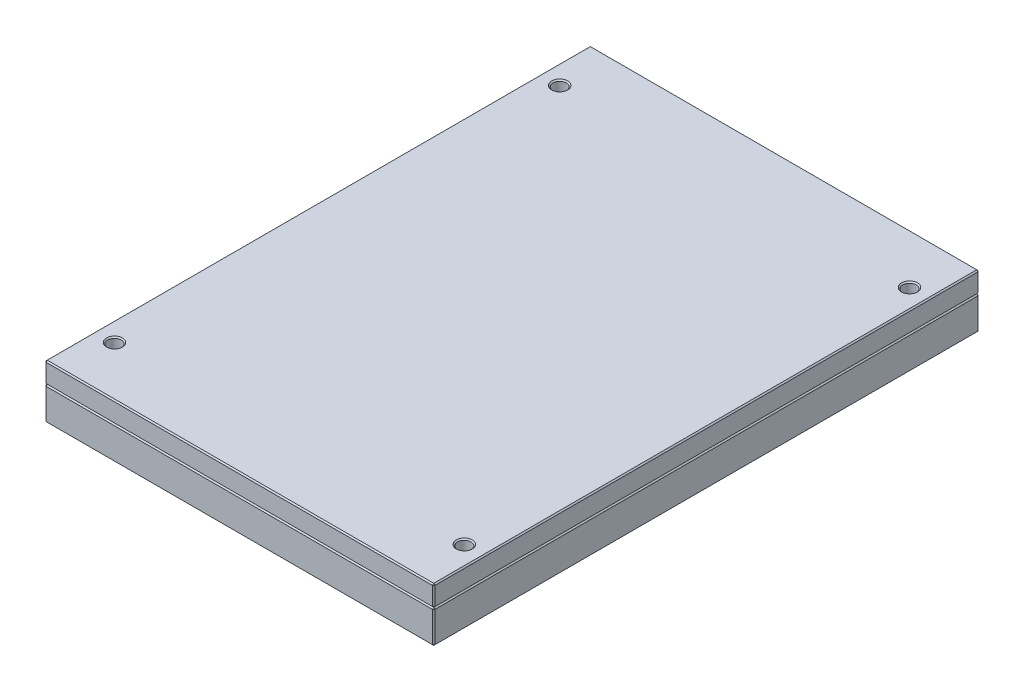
ISO-10303-21;
HEADER;
FILE_DESCRIPTION(('STEP AP214'),'2;1');
FILE_NAME('part.step','',(''),(''),'','','');
FILE_SCHEMA(('AUTOMOTIVE_DESIGN { 1 0 10303 214 1 1 1 1 }'));
ENDSEC;
DATA;
#1=APPLICATION_CONTEXT('core data for automotive mechanical design processes');
#2=APPLICATION_PROTOCOL_DEFINITION('international standard','automotive_design',2000,#1);
#3=PRODUCT_CONTEXT('',#1,'mechanical');
#4=PRODUCT('Part','Part','',(#3));
#5=PRODUCT_RELATED_PRODUCT_CATEGORY('part','',(#4));
#6=PRODUCT_DEFINITION_FORMATION('','',#4);
#7=PRODUCT_DEFINITION_CONTEXT('part definition',#1,'design');
#8=PRODUCT_DEFINITION('design','',#6,#7);
#9=PRODUCT_DEFINITION_SHAPE('','',#8);
#10=(LENGTH_UNIT() NAMED_UNIT(*) SI_UNIT(.MILLI.,.METRE.));
#11=(NAMED_UNIT(*) PLANE_ANGLE_UNIT() SI_UNIT($,.RADIAN.));
#12=(NAMED_UNIT(*) SI_UNIT($,.STERADIAN.) SOLID_ANGLE_UNIT());
#13=UNCERTAINTY_MEASURE_WITH_UNIT(LENGTH_MEASURE(1.E-05),#10,'distance_accuracy_value','');
#14=(GEOMETRIC_REPRESENTATION_CONTEXT(3) GLOBAL_UNCERTAINTY_ASSIGNED_CONTEXT((#13)) GLOBAL_UNIT_ASSIGNED_CONTEXT((#10,
#11,#12)) REPRESENTATION_CONTEXT('',''));
#15=CARTESIAN_POINT('',(0.,0.,0.));
#16=DIRECTION('',(0.,0.,1.));
#17=DIRECTION('',(1.,0.,0.));
#18=AXIS2_PLACEMENT_3D('',#15,#16,#17);
#19=CARTESIAN_POINT('',(-159.,44.,223.));
#20=DIRECTION('',(1.,0.,0.));
#21=DIRECTION('',(0.,0.,-1.));
#22=AXIS2_PLACEMENT_3D('',#19,#20,#21);
#23=PLANE('',#22);
#24=DIRECTION('',(0.,0.,1.));
#25=VECTOR('',#24,1.);
#26=CARTESIAN_POINT('',(-159.,28.,223.));
#27=LINE('',#26,#25);
#28=CARTESIAN_POINT('',(-159.,28.,-222.));
#29=VERTEX_POINT('',#28);
#30=CARTESIAN_POINT('',(-159.,28.,222.));
#31=VERTEX_POINT('',#30);
#32=EDGE_CURVE('P0_E220',#29,#31,#27,.T.);
#33=ORIENTED_EDGE('',*,*,#32,.T.);
#34=DIRECTION('',(0.,1.,0.));
#35=VECTOR('',#34,1.);
#36=CARTESIAN_POINT('',(-159.,44.,222.));
#37=LINE('',#36,#35);
#38=CARTESIAN_POINT('',(-159.,43.,222.));
#39=VERTEX_POINT('',#38);
#40=EDGE_CURVE('P0_E222',#31,#39,#37,.T.);
#41=ORIENTED_EDGE('',*,*,#40,.T.);
#42=DIRECTION('',(0.,0.,-1.));
#43=VECTOR('',#42,1.);
#44=CARTESIAN_POINT('',(-159.,43.,-223.));
#45=LINE('',#44,#43);
#46=CARTESIAN_POINT('',(-159.,43.,-222.));
#47=VERTEX_POINT('',#46);
#48=EDGE_CURVE('P0_E216',#39,#47,#45,.T.);
#49=ORIENTED_EDGE('',*,*,#48,.T.);
#50=DIRECTION('',(0.,-1.,0.));
#51=VECTOR('',#50,1.);
#52=CARTESIAN_POINT('',(-159.,44.,-222.));
#53=LINE('',#52,#51);
#54=EDGE_CURVE('P0_E218',#47,#29,#53,.T.);
#55=ORIENTED_EDGE('',*,*,#54,.T.);
#56=EDGE_LOOP('',(#33,#41,#49,#55));
#57=FACE_BOUND('',#56,.T.);
#58=ADVANCED_FACE('P0_F16',(#57),#23,.F.);
#59=CARTESIAN_POINT('',(159.,44.,223.));
#60=DIRECTION('',(0.,0.,-1.));
#61=DIRECTION('',(-1.,0.,0.));
#62=AXIS2_PLACEMENT_3D('',#59,#60,#61);
#63=PLANE('',#62);
#64=DIRECTION('',(0.,-1.,0.));
#65=VECTOR('',#64,1.);
#66=CARTESIAN_POINT('',(-158.,44.,223.));
#67=LINE('',#66,#65);
#68=CARTESIAN_POINT('',(-158.,43.,223.));
#69=VERTEX_POINT('',#68);
#70=CARTESIAN_POINT('',(-158.,28.,223.));
#71=VERTEX_POINT('',#70);
#72=EDGE_CURVE('P0_E116',#69,#71,#67,.T.);
#73=ORIENTED_EDGE('',*,*,#72,.T.);
#74=DIRECTION('',(1.,0.,0.));
#75=VECTOR('',#74,1.);
#76=CARTESIAN_POINT('',(159.,28.,223.));
#77=LINE('',#76,#75);
#78=CARTESIAN_POINT('',(158.,28.,223.));
#79=VERTEX_POINT('',#78);
#80=EDGE_CURVE('P0_E112',#71,#79,#77,.T.);
#81=ORIENTED_EDGE('',*,*,#80,.T.);
#82=DIRECTION('',(0.,1.,0.));
#83=VECTOR('',#82,1.);
#84=CARTESIAN_POINT('',(158.,44.,223.));
#85=LINE('',#84,#83);
#86=CARTESIAN_POINT('',(158.,43.,223.));
#87=VERTEX_POINT('',#86);
#88=EDGE_CURVE('P0_E106',#79,#87,#85,.T.);
#89=ORIENTED_EDGE('',*,*,#88,.T.);
#90=DIRECTION('',(-1.,0.,0.));
#91=VECTOR('',#90,1.);
#92=CARTESIAN_POINT('',(-159.,43.,223.));
#93=LINE('',#92,#91);
#94=EDGE_CURVE('P0_E109',#87,#69,#93,.T.);
#95=ORIENTED_EDGE('',*,*,#94,.T.);
#96=EDGE_LOOP('',(#73,#81,#89,#95));
#97=FACE_BOUND('',#96,.T.);
#98=ADVANCED_FACE('P0_F108',(#97),#63,.F.);
#99=CARTESIAN_POINT('',(159.,44.,223.));
#100=DIRECTION('',(-1.,0.,0.));
#101=DIRECTION('',(0.,0.,1.));
#102=AXIS2_PLACEMENT_3D('',#99,#100,#101);
#103=PLANE('',#102);
#104=DIRECTION('',(0.,0.,1.));
#105=VECTOR('',#104,1.);
#106=CARTESIAN_POINT('',(159.,43.,223.));
#107=LINE('',#106,#105);
#108=CARTESIAN_POINT('',(159.,43.,-222.));
#109=VERTEX_POINT('',#108);
#110=CARTESIAN_POINT('',(159.,43.,222.));
#111=VERTEX_POINT('',#110);
#112=EDGE_CURVE('P0_E234',#109,#111,#107,.T.);
#113=ORIENTED_EDGE('',*,*,#112,.T.);
#114=DIRECTION('',(0.,-1.,0.));
#115=VECTOR('',#114,1.);
#116=CARTESIAN_POINT('',(159.,44.,222.));
#117=LINE('',#116,#115);
#118=CARTESIAN_POINT('',(159.,28.,222.));
#119=VERTEX_POINT('',#118);
#120=EDGE_CURVE('P0_E139',#111,#119,#117,.T.);
#121=ORIENTED_EDGE('',*,*,#120,.T.);
#122=DIRECTION('',(0.,0.,-1.));
#123=VECTOR('',#122,1.);
#124=CARTESIAN_POINT('',(159.,28.,223.));
#125=LINE('',#124,#123);
#126=CARTESIAN_POINT('',(159.,28.,-222.));
#127=VERTEX_POINT('',#126);
#128=EDGE_CURVE('P0_E238',#119,#127,#125,.T.);
#129=ORIENTED_EDGE('',*,*,#128,.T.);
#130=DIRECTION('',(0.,1.,0.));
#131=VECTOR('',#130,1.);
#132=CARTESIAN_POINT('',(159.,44.,-222.));
#133=LINE('',#132,#131);
#134=EDGE_CURVE('P0_E236',#127,#109,#133,.T.);
#135=ORIENTED_EDGE('',*,*,#134,.T.);
#136=EDGE_LOOP('',(#113,#121,#129,#135));
#137=FACE_BOUND('',#136,.T.);
#138=ADVANCED_FACE('P0_F307',(#137),#103,.F.);
#139=CARTESIAN_POINT('',(159.,44.,-223.));
#140=DIRECTION('',(0.,0.,1.));
#141=DIRECTION('',(1.,0.,0.));
#142=AXIS2_PLACEMENT_3D('',#139,#140,#141);
#143=PLANE('',#142);
#144=DIRECTION('',(-1.,0.,0.));
#145=VECTOR('',#144,1.);
#146=CARTESIAN_POINT('',(159.,28.,-223.));
#147=LINE('',#146,#145);
#148=CARTESIAN_POINT('',(158.,28.,-223.));
#149=VERTEX_POINT('',#148);
#150=CARTESIAN_POINT('',(-158.,28.,-223.));
#151=VERTEX_POINT('',#150);
#152=EDGE_CURVE('P0_E229',#149,#151,#147,.T.);
#153=ORIENTED_EDGE('',*,*,#152,.T.);
#154=DIRECTION('',(0.,1.,0.));
#155=VECTOR('',#154,1.);
#156=CARTESIAN_POINT('',(-158.,44.,-223.));
#157=LINE('',#156,#155);
#158=CARTESIAN_POINT('',(-158.,43.,-223.));
#159=VERTEX_POINT('',#158);
#160=EDGE_CURVE('P0_E231',#151,#159,#157,.T.);
#161=ORIENTED_EDGE('',*,*,#160,.T.);
#162=DIRECTION('',(1.,0.,0.));
#163=VECTOR('',#162,1.);
#164=CARTESIAN_POINT('',(159.,43.,-223.));
#165=LINE('',#164,#163);
#166=CARTESIAN_POINT('',(158.,43.,-223.));
#167=VERTEX_POINT('',#166);
#168=EDGE_CURVE('P0_E225',#159,#167,#165,.T.);
#169=ORIENTED_EDGE('',*,*,#168,.T.);
#170=DIRECTION('',(0.,-1.,0.));
#171=VECTOR('',#170,1.);
#172=CARTESIAN_POINT('',(158.,44.,-223.));
#173=LINE('',#172,#171);
#174=EDGE_CURVE('P0_E227',#167,#149,#173,.T.);
#175=ORIENTED_EDGE('',*,*,#174,.T.);
#176=EDGE_LOOP('',(#153,#161,#169,#175));
#177=FACE_BOUND('',#176,.T.);
#178=ADVANCED_FACE('P0_F318',(#177),#143,.F.);
#179=CARTESIAN_POINT('',(0.,44.,0.));
#180=DIRECTION('',(0.,1.,0.));
#181=DIRECTION('',(0.,0.,1.));
#182=AXIS2_PLACEMENT_3D('',#179,#180,#181);
#183=PLANE('',#182);
#184=DIRECTION('',(0.,0.,-1.));
#185=VECTOR('',#184,1.);
#186=CARTESIAN_POINT('',(158.,44.,-223.));
#187=LINE('',#186,#185);
#188=CARTESIAN_POINT('',(158.,44.,222.));
#189=VERTEX_POINT('',#188);
#190=CARTESIAN_POINT('',(158.,44.,-222.));
#191=VERTEX_POINT('',#190);
#192=EDGE_CURVE('P0_E33',#189,#191,#187,.T.);
#193=ORIENTED_EDGE('',*,*,#192,.T.);
#194=DIRECTION('',(-1.,0.,0.));
#195=VECTOR('',#194,1.);
#196=CARTESIAN_POINT('',(-159.,44.,-222.));
#197=LINE('',#196,#195);
#198=CARTESIAN_POINT('',(-158.,44.,-222.));
#199=VERTEX_POINT('',#198);
#200=EDGE_CURVE('P0_E257',#191,#199,#197,.T.);
#201=ORIENTED_EDGE('',*,*,#200,.T.);
#202=DIRECTION('',(0.,0.,1.));
#203=VECTOR('',#202,1.);
#204=CARTESIAN_POINT('',(-158.,44.,223.));
#205=LINE('',#204,#203);
#206=CARTESIAN_POINT('',(-158.,44.,222.));
#207=VERTEX_POINT('',#206);
#208=EDGE_CURVE('P0_E253',#199,#207,#205,.T.);
#209=ORIENTED_EDGE('',*,*,#208,.T.);
#210=DIRECTION('',(1.,0.,0.));
#211=VECTOR('',#210,1.);
#212=CARTESIAN_POINT('',(159.,44.,222.));
#213=LINE('',#212,#211);
#214=EDGE_CURVE('P0_E38',#207,#189,#213,.T.);
#215=ORIENTED_EDGE('',*,*,#214,.T.);
#216=EDGE_LOOP('',(#193,#201,#209,#215));
#217=FACE_BOUND('',#216,.T.);
#218=CARTESIAN_POINT('',(143.,44.,182.));
#219=DIRECTION('',(0.,1.,0.));
#220=DIRECTION('',(0.,0.,1.));
#221=AXIS2_PLACEMENT_3D('',#218,#219,#220);
#222=CIRCLE('',#221,6.50000000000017);
#223=CARTESIAN_POINT('',(143.,44.,188.5));
#224=VERTEX_POINT('',#223);
#225=EDGE_CURVE('P0_E250',#224,#224,#222,.F.);
#226=ORIENTED_EDGE('',*,*,#225,.T.);
#227=EDGE_LOOP('',(#226));
#228=FACE_BOUND('',#227,.T.);
#229=CARTESIAN_POINT('',(-143.,44.,182.));
#230=DIRECTION('',(0.,1.,0.));
#231=DIRECTION('',(0.,0.,1.));
#232=AXIS2_PLACEMENT_3D('',#229,#230,#231);
#233=CIRCLE('',#232,6.50000000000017);
#234=CARTESIAN_POINT('',(-143.,44.,188.5));
#235=VERTEX_POINT('',#234);
#236=EDGE_CURVE('P0_E247',#235,#235,#233,.F.);
#237=ORIENTED_EDGE('',*,*,#236,.T.);
#238=EDGE_LOOP('',(#237));
#239=FACE_BOUND('',#238,.T.);
#240=CARTESIAN_POINT('',(143.,44.,-182.));
#241=DIRECTION('',(0.,1.,0.));
#242=DIRECTION('',(0.,0.,1.));
#243=AXIS2_PLACEMENT_3D('',#240,#241,#242);
#244=CIRCLE('',#243,6.50000000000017);
#245=CARTESIAN_POINT('',(143.,44.,-175.5));
#246=VERTEX_POINT('',#245);
#247=EDGE_CURVE('P0_E244',#246,#246,#244,.F.);
#248=ORIENTED_EDGE('',*,*,#247,.T.);
#249=EDGE_LOOP('',(#248));
#250=FACE_BOUND('',#249,.T.);
#251=CARTESIAN_POINT('',(-143.,44.,-182.));
#252=DIRECTION('',(0.,1.,0.));
#253=DIRECTION('',(0.,0.,1.));
#254=AXIS2_PLACEMENT_3D('',#251,#252,#253);
#255=CIRCLE('',#254,6.50000000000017);
#256=CARTESIAN_POINT('',(-143.,44.,-175.5));
#257=VERTEX_POINT('',#256);
#258=EDGE_CURVE('P0_E241',#257,#257,#255,.F.);
#259=ORIENTED_EDGE('',*,*,#258,.T.);
#260=EDGE_LOOP('',(#259));
#261=FACE_BOUND('',#260,.T.);
#262=ADVANCED_FACE('P0_F335',(#217,#228,#239,#250,#261),#183,.T.);
#263=CARTESIAN_POINT('',(0.,27.,0.));
#264=DIRECTION('',(0.,1.,0.));
#265=DIRECTION('',(0.,0.,1.));
#266=AXIS2_PLACEMENT_3D('',#263,#264,#265);
#267=PLANE('',#266);
#268=DIRECTION('',(0.,0.,1.));
#269=VECTOR('',#268,1.);
#270=CARTESIAN_POINT('',(158.,27.,0.));
#271=LINE('',#270,#269);
#272=CARTESIAN_POINT('',(158.,27.,-222.));
#273=VERTEX_POINT('',#272);
#274=CARTESIAN_POINT('',(158.,27.,222.));
#275=VERTEX_POINT('',#274);
#276=EDGE_CURVE('P0_E207',#273,#275,#271,.T.);
#277=ORIENTED_EDGE('',*,*,#276,.T.);
#278=DIRECTION('',(-1.,0.,0.));
#279=VECTOR('',#278,1.);
#280=CARTESIAN_POINT('',(0.,27.,222.));
#281=LINE('',#280,#279);
#282=CARTESIAN_POINT('',(-158.,27.,222.));
#283=VERTEX_POINT('',#282);
#284=EDGE_CURVE('P0_E213',#275,#283,#281,.T.);
#285=ORIENTED_EDGE('',*,*,#284,.T.);
#286=DIRECTION('',(0.,0.,-1.));
#287=VECTOR('',#286,1.);
#288=CARTESIAN_POINT('',(-158.,27.,0.));
#289=LINE('',#288,#287);
#290=CARTESIAN_POINT('',(-158.,27.,-222.));
#291=VERTEX_POINT('',#290);
#292=EDGE_CURVE('P0_E211',#283,#291,#289,.T.);
#293=ORIENTED_EDGE('',*,*,#292,.T.);
#294=DIRECTION('',(1.,0.,0.));
#295=VECTOR('',#294,1.);
#296=CARTESIAN_POINT('',(0.,27.,-222.));
#297=LINE('',#296,#295);
#298=EDGE_CURVE('P0_E209',#291,#273,#297,.T.);
#299=ORIENTED_EDGE('',*,*,#298,.T.);
#300=EDGE_LOOP('',(#277,#285,#293,#299));
#301=FACE_BOUND('',#300,.T.);
#302=CARTESIAN_POINT('',(-143.,27.,-182.));
#303=DIRECTION('',(0.,1.,0.));
#304=DIRECTION('',(0.,0.,1.));
#305=AXIS2_PLACEMENT_3D('',#302,#303,#304);
#306=CIRCLE('',#305,5.5);
#307=CARTESIAN_POINT('',(-143.,27.,-176.5));
#308=VERTEX_POINT('',#307);
#309=EDGE_CURVE('P0_E127',#308,#308,#306,.T.);
#310=ORIENTED_EDGE('',*,*,#309,.T.);
#311=EDGE_LOOP('',(#310));
#312=FACE_BOUND('',#311,.T.);
#313=CARTESIAN_POINT('',(143.,27.,-182.));
#314=DIRECTION('',(0.,1.,0.));
#315=DIRECTION('',(0.,0.,1.));
#316=AXIS2_PLACEMENT_3D('',#313,#314,#315);
#317=CIRCLE('',#316,5.5);
#318=CARTESIAN_POINT('',(143.,27.,-176.5));
#319=VERTEX_POINT('',#318);
#320=EDGE_CURVE('P0_E198',#319,#319,#317,.T.);
#321=ORIENTED_EDGE('',*,*,#320,.T.);
#322=EDGE_LOOP('',(#321));
#323=FACE_BOUND('',#322,.T.);
#324=CARTESIAN_POINT('',(-143.,27.,182.));
#325=DIRECTION('',(0.,1.,0.));
#326=DIRECTION('',(0.,0.,1.));
#327=AXIS2_PLACEMENT_3D('',#324,#325,#326);
#328=CIRCLE('',#327,5.5);
#329=CARTESIAN_POINT('',(-143.,27.,187.5));
#330=VERTEX_POINT('',#329);
#331=EDGE_CURVE('P0_E193',#330,#330,#328,.T.);
#332=ORIENTED_EDGE('',*,*,#331,.T.);
#333=EDGE_LOOP('',(#332));
#334=FACE_BOUND('',#333,.T.);
#335=CARTESIAN_POINT('',(143.,27.,182.));
#336=DIRECTION('',(0.,1.,0.));
#337=DIRECTION('',(0.,0.,1.));
#338=AXIS2_PLACEMENT_3D('',#335,#336,#337);
#339=CIRCLE('',#338,5.5);
#340=CARTESIAN_POINT('',(143.,27.,187.5));
#341=VERTEX_POINT('',#340);
#342=EDGE_CURVE('P0_E186',#341,#341,#339,.T.);
#343=ORIENTED_EDGE('',*,*,#342,.T.);
#344=EDGE_LOOP('',(#343));
#345=FACE_BOUND('',#344,.T.);
#346=ADVANCED_FACE('P0_F292',(#301,#312,#323,#334,#345),#267,.F.);
#347=CARTESIAN_POINT('',(143.,0.,182.));
#348=DIRECTION('',(0.,1.,0.));
#349=DIRECTION('',(0.,0.,1.));
#350=AXIS2_PLACEMENT_3D('',#347,#348,#349);
#351=CYLINDRICAL_SURFACE('',#350,5.5);
#352=CARTESIAN_POINT('',(143.,43.,182.));
#353=DIRECTION('',(0.,1.,0.));
#354=DIRECTION('',(0.,0.,1.));
#355=AXIS2_PLACEMENT_3D('',#352,#353,#354);
#356=CIRCLE('',#355,5.5);
#357=CARTESIAN_POINT('',(143.,43.,187.5));
#358=VERTEX_POINT('',#357);
#359=EDGE_CURVE('P0_E259',#358,#358,#356,.T.);
#360=ORIENTED_EDGE('',*,*,#359,.T.);
#361=EDGE_LOOP('',(#360));
#362=FACE_BOUND('',#361,.T.);
#363=ORIENTED_EDGE('',*,*,#342,.F.);
#364=EDGE_LOOP('',(#363));
#365=FACE_BOUND('',#364,.T.);
#366=ADVANCED_FACE('P0_F427',(#362,#365),#351,.F.);
#367=CARTESIAN_POINT('',(-143.,0.,182.));
#368=DIRECTION('',(0.,1.,0.));
#369=DIRECTION('',(0.,0.,1.));
#370=AXIS2_PLACEMENT_3D('',#367,#368,#369);
#371=CYLINDRICAL_SURFACE('',#370,5.5);
#372=CARTESIAN_POINT('',(-143.,43.,182.));
#373=DIRECTION('',(0.,1.,0.));
#374=DIRECTION('',(0.,0.,1.));
#375=AXIS2_PLACEMENT_3D('',#372,#373,#374);
#376=CIRCLE('',#375,5.5);
#377=CARTESIAN_POINT('',(-143.,43.,187.5));
#378=VERTEX_POINT('',#377);
#379=EDGE_CURVE('P0_E262',#378,#378,#376,.T.);
#380=ORIENTED_EDGE('',*,*,#379,.T.);
#381=EDGE_LOOP('',(#380));
#382=FACE_BOUND('',#381,.T.);
#383=ORIENTED_EDGE('',*,*,#331,.F.);
#384=EDGE_LOOP('',(#383));
#385=FACE_BOUND('',#384,.T.);
#386=ADVANCED_FACE('P0_F421',(#382,#385),#371,.F.);
#387=CARTESIAN_POINT('',(143.,0.,-182.));
#388=DIRECTION('',(0.,1.,0.));
#389=DIRECTION('',(0.,0.,1.));
#390=AXIS2_PLACEMENT_3D('',#387,#388,#389);
#391=CYLINDRICAL_SURFACE('',#390,5.5);
#392=CARTESIAN_POINT('',(143.,43.,-182.));
#393=DIRECTION('',(0.,1.,0.));
#394=DIRECTION('',(0.,0.,1.));
#395=AXIS2_PLACEMENT_3D('',#392,#393,#394);
#396=CIRCLE('',#395,5.5);
#397=CARTESIAN_POINT('',(143.,43.,-176.5));
#398=VERTEX_POINT('',#397);
#399=EDGE_CURVE('P0_E25',#398,#398,#396,.T.);
#400=ORIENTED_EDGE('',*,*,#399,.T.);
#401=EDGE_LOOP('',(#400));
#402=FACE_BOUND('',#401,.T.);
#403=ORIENTED_EDGE('',*,*,#320,.F.);
#404=EDGE_LOOP('',(#403));
#405=FACE_BOUND('',#404,.T.);
#406=ADVANCED_FACE('P0_F418',(#402,#405),#391,.F.);
#407=CARTESIAN_POINT('',(-143.,0.,-182.));
#408=DIRECTION('',(0.,1.,0.));
#409=DIRECTION('',(0.,0.,1.));
#410=AXIS2_PLACEMENT_3D('',#407,#408,#409);
#411=CYLINDRICAL_SURFACE('',#410,5.5);
#412=CARTESIAN_POINT('',(-143.,43.,-182.));
#413=DIRECTION('',(0.,1.,0.));
#414=DIRECTION('',(0.,0.,1.));
#415=AXIS2_PLACEMENT_3D('',#412,#413,#414);
#416=CIRCLE('',#415,5.5);
#417=CARTESIAN_POINT('',(-143.,43.,-176.5));
#418=VERTEX_POINT('',#417);
#419=EDGE_CURVE('P0_E10',#418,#418,#416,.T.);
#420=ORIENTED_EDGE('',*,*,#419,.T.);
#421=EDGE_LOOP('',(#420));
#422=FACE_BOUND('',#421,.T.);
#423=ORIENTED_EDGE('',*,*,#309,.F.);
#424=EDGE_LOOP('',(#423));
#425=FACE_BOUND('',#424,.T.);
#426=ADVANCED_FACE('P0_F399',(#422,#425),#411,.F.);
#427=CARTESIAN_POINT('',(0.,44.,-222.));
#428=DIRECTION('',(0.,0.707106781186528,-0.707106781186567));
#429=DIRECTION('',(1.,0.,0.));
#430=AXIS2_PLACEMENT_3D('',#427,#428,#429);
#431=PLANE('',#430);
#432=DIRECTION('',(0.,-0.707106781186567,-0.707106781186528));
#433=VECTOR('',#432,1.);
#434=CARTESIAN_POINT('',(-158.,43.,-223.));
#435=LINE('',#434,#433);
#436=EDGE_CURVE('P0_E20',#199,#159,#435,.T.);
#437=ORIENTED_EDGE('',*,*,#436,.F.);
#438=ORIENTED_EDGE('',*,*,#200,.F.);
#439=DIRECTION('',(0.,0.707106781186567,0.707106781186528));
#440=VECTOR('',#439,1.);
#441=CARTESIAN_POINT('',(158.,43.5,-222.5));
#442=LINE('',#441,#440);
#443=EDGE_CURVE('P0_E179',#167,#191,#442,.T.);
#444=ORIENTED_EDGE('',*,*,#443,.F.);
#445=ORIENTED_EDGE('',*,*,#168,.F.);
#446=EDGE_LOOP('',(#437,#438,#444,#445));
#447=FACE_BOUND('',#446,.T.);
#448=ADVANCED_FACE('P0_F334',(#447),#431,.T.);
#449=CARTESIAN_POINT('',(-158.,43.,-223.));
#450=DIRECTION('',(-0.577350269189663,0.577350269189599,-0.577350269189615));
#451=DIRECTION('',(-0.707106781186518,0.,0.707106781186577));
#452=AXIS2_PLACEMENT_3D('',#449,#450,#451);
#453=PLANE('',#452);
#454=DIRECTION('',(0.707106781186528,0.707106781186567,0.));
#455=VECTOR('',#454,1.);
#456=CARTESIAN_POINT('',(-158.5,43.5,-222.));
#457=LINE('',#456,#455);
#458=EDGE_CURVE('P0_E175',#199,#47,#457,.F.);
#459=ORIENTED_EDGE('',*,*,#458,.F.);
#460=ORIENTED_EDGE('',*,*,#436,.T.);
#461=DIRECTION('',(0.707106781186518,0.,-0.707106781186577));
#462=VECTOR('',#461,1.);
#463=CARTESIAN_POINT('',(-158.,43.,-223.));
#464=LINE('',#463,#462);
#465=EDGE_CURVE('P0_E178',#47,#159,#464,.T.);
#466=ORIENTED_EDGE('',*,*,#465,.F.);
#467=EDGE_LOOP('',(#459,#460,#466));
#468=FACE_BOUND('',#467,.T.);
#469=ADVANCED_FACE('P0_F330',(#468),#453,.T.);
#470=CARTESIAN_POINT('',(159.,43.,-222.));
#471=DIRECTION('',(0.577350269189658,0.577350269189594,-0.577350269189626));
#472=DIRECTION('',(-0.707106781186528,0.,-0.707106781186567));
#473=AXIS2_PLACEMENT_3D('',#470,#471,#472);
#474=PLANE('',#473);
#475=DIRECTION('',(0.707106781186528,0.,0.707106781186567));
#476=VECTOR('',#475,1.);
#477=CARTESIAN_POINT('',(159.,43.,-222.));
#478=LINE('',#477,#476);
#479=EDGE_CURVE('P0_E169',#167,#109,#478,.T.);
#480=ORIENTED_EDGE('',*,*,#479,.F.);
#481=ORIENTED_EDGE('',*,*,#443,.T.);
#482=DIRECTION('',(0.707106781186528,-0.707106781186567,0.));
#483=VECTOR('',#482,1.);
#484=CARTESIAN_POINT('',(159.,43.,-222.));
#485=LINE('',#484,#483);
#486=EDGE_CURVE('P0_E172',#109,#191,#485,.F.);
#487=ORIENTED_EDGE('',*,*,#486,.F.);
#488=EDGE_LOOP('',(#480,#481,#487));
#489=FACE_BOUND('',#488,.T.);
#490=ADVANCED_FACE('P0_F311',(#489),#474,.T.);
#491=CARTESIAN_POINT('',(-159.,44.,-222.));
#492=DIRECTION('',(0.707106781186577,0.,0.707106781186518));
#493=DIRECTION('',(0.,-1.,0.));
#494=AXIS2_PLACEMENT_3D('',#491,#492,#493);
#495=PLANE('',#494);
#496=ORIENTED_EDGE('',*,*,#465,.T.);
#497=ORIENTED_EDGE('',*,*,#160,.F.);
#498=DIRECTION('',(-0.707106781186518,0.,0.707106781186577));
#499=VECTOR('',#498,1.);
#500=CARTESIAN_POINT('',(-158.5,28.,-222.5));
#501=LINE('',#500,#499);
#502=EDGE_CURVE('P0_E163',#29,#151,#501,.F.);
#503=ORIENTED_EDGE('',*,*,#502,.F.);
#504=ORIENTED_EDGE('',*,*,#54,.F.);
#505=EDGE_LOOP('',(#496,#497,#503,#504));
#506=FACE_BOUND('',#505,.T.);
#507=ADVANCED_FACE('P0_F329',(#506),#495,.F.);
#508=CARTESIAN_POINT('',(-158.,44.,0.));
#509=DIRECTION('',(-0.707106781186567,0.707106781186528,0.));
#510=DIRECTION('',(0.,0.,-1.));
#511=AXIS2_PLACEMENT_3D('',#508,#509,#510);
#512=PLANE('',#511);
#513=ORIENTED_EDGE('',*,*,#458,.T.);
#514=ORIENTED_EDGE('',*,*,#48,.F.);
#515=DIRECTION('',(-0.707106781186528,-0.707106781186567,0.));
#516=VECTOR('',#515,1.);
#517=CARTESIAN_POINT('',(-159.,43.,222.));
#518=LINE('',#517,#516);
#519=EDGE_CURVE('P0_E160',#207,#39,#518,.T.);
#520=ORIENTED_EDGE('',*,*,#519,.F.);
#521=ORIENTED_EDGE('',*,*,#208,.F.);
#522=EDGE_LOOP('',(#513,#514,#520,#521));
#523=FACE_BOUND('',#522,.T.);
#524=ADVANCED_FACE('P0_F338',(#523),#512,.T.);
#525=CARTESIAN_POINT('',(0.,44.,222.));
#526=DIRECTION('',(0.,0.707106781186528,0.707106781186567));
#527=DIRECTION('',(-1.,0.,0.));
#528=AXIS2_PLACEMENT_3D('',#525,#526,#527);
#529=PLANE('',#528);
#530=DIRECTION('',(0.,-0.707106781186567,0.707106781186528));
#531=VECTOR('',#530,1.);
#532=CARTESIAN_POINT('',(158.,43.,223.));
#533=LINE('',#532,#531);
#534=EDGE_CURVE('P0_E122',#189,#87,#533,.T.);
#535=ORIENTED_EDGE('',*,*,#534,.F.);
#536=ORIENTED_EDGE('',*,*,#214,.F.);
#537=DIRECTION('',(0.,0.707106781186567,-0.707106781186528));
#538=VECTOR('',#537,1.);
#539=CARTESIAN_POINT('',(-158.,43.5,222.5));
#540=LINE('',#539,#538);
#541=EDGE_CURVE('P0_E125',#69,#207,#540,.T.);
#542=ORIENTED_EDGE('',*,*,#541,.F.);
#543=ORIENTED_EDGE('',*,*,#94,.F.);
#544=EDGE_LOOP('',(#535,#536,#542,#543));
#545=FACE_BOUND('',#544,.T.);
#546=ADVANCED_FACE('P0_F121',(#545),#529,.T.);
#547=CARTESIAN_POINT('',(158.,44.,0.));
#548=DIRECTION('',(0.707106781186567,0.707106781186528,0.));
#549=DIRECTION('',(0.,0.,1.));
#550=AXIS2_PLACEMENT_3D('',#547,#548,#549);
#551=PLANE('',#550);
#552=ORIENTED_EDGE('',*,*,#486,.T.);
#553=ORIENTED_EDGE('',*,*,#192,.F.);
#554=DIRECTION('',(-0.707106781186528,0.707106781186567,0.));
#555=VECTOR('',#554,1.);
#556=CARTESIAN_POINT('',(158.5,43.5,222.));
#557=LINE('',#556,#555);
#558=EDGE_CURVE('P0_E135',#111,#189,#557,.T.);
#559=ORIENTED_EDGE('',*,*,#558,.F.);
#560=ORIENTED_EDGE('',*,*,#112,.F.);
#561=EDGE_LOOP('',(#552,#553,#559,#560));
#562=FACE_BOUND('',#561,.T.);
#563=ADVANCED_FACE('P0_F310',(#562),#551,.T.);
#564=CARTESIAN_POINT('',(158.,44.,-223.));
#565=DIRECTION('',(-0.707106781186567,0.,0.707106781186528));
#566=DIRECTION('',(0.,-1.,0.));
#567=AXIS2_PLACEMENT_3D('',#564,#565,#566);
#568=PLANE('',#567);
#569=ORIENTED_EDGE('',*,*,#479,.T.);
#570=ORIENTED_EDGE('',*,*,#134,.F.);
#571=DIRECTION('',(-0.707106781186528,0.,-0.707106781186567));
#572=VECTOR('',#571,1.);
#573=CARTESIAN_POINT('',(158.5,28.,-222.5));
#574=LINE('',#573,#572);
#575=EDGE_CURVE('P0_E155',#149,#127,#574,.F.);
#576=ORIENTED_EDGE('',*,*,#575,.F.);
#577=ORIENTED_EDGE('',*,*,#174,.F.);
#578=EDGE_LOOP('',(#569,#570,#576,#577));
#579=FACE_BOUND('',#578,.T.);
#580=ADVANCED_FACE('P0_F315',(#579),#568,.F.);
#581=CARTESIAN_POINT('',(159.,28.,-223.));
#582=DIRECTION('',(0.,0.707106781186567,0.707106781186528));
#583=DIRECTION('',(-1.,0.,0.));
#584=AXIS2_PLACEMENT_3D('',#581,#582,#583);
#585=PLANE('',#584);
#586=DIRECTION('',(0.,0.707106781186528,-0.707106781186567));
#587=VECTOR('',#586,1.);
#588=CARTESIAN_POINT('',(-158.,27.,-222.));
#589=LINE('',#588,#587);
#590=EDGE_CURVE('P0_E166',#151,#291,#589,.F.);
#591=ORIENTED_EDGE('',*,*,#590,.F.);
#592=ORIENTED_EDGE('',*,*,#152,.F.);
#593=DIRECTION('',(0.,-0.707106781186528,0.707106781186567));
#594=VECTOR('',#593,1.);
#595=CARTESIAN_POINT('',(158.,27.,-222.));
#596=LINE('',#595,#594);
#597=EDGE_CURVE('P0_E152',#273,#149,#596,.F.);
#598=ORIENTED_EDGE('',*,*,#597,.F.);
#599=ORIENTED_EDGE('',*,*,#298,.F.);
#600=EDGE_LOOP('',(#591,#592,#598,#599));
#601=FACE_BOUND('',#600,.T.);
#602=ADVANCED_FACE('P0_F323',(#601),#585,.F.);
#603=CARTESIAN_POINT('',(-158.,27.,-222.));
#604=DIRECTION('',(-0.577350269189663,-0.577350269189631,-0.577350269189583));
#605=DIRECTION('',(0.707106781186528,-0.707106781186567,0.));
#606=AXIS2_PLACEMENT_3D('',#603,#604,#605);
#607=PLANE('',#606);
#608=ORIENTED_EDGE('',*,*,#502,.T.);
#609=ORIENTED_EDGE('',*,*,#590,.T.);
#610=DIRECTION('',(0.707106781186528,-0.707106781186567,0.));
#611=VECTOR('',#610,1.);
#612=CARTESIAN_POINT('',(-158.,27.,-222.));
#613=LINE('',#612,#611);
#614=EDGE_CURVE('P0_E143',#29,#291,#613,.T.);
#615=ORIENTED_EDGE('',*,*,#614,.F.);
#616=EDGE_LOOP('',(#608,#609,#615));
#617=FACE_BOUND('',#616,.T.);
#618=ADVANCED_FACE('P0_F326',(#617),#607,.T.);
#619=CARTESIAN_POINT('',(-159.,43.,222.));
#620=DIRECTION('',(-0.577350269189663,0.577350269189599,0.577350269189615));
#621=DIRECTION('',(0.707106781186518,0.,0.707106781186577));
#622=AXIS2_PLACEMENT_3D('',#619,#620,#621);
#623=PLANE('',#622);
#624=ORIENTED_EDGE('',*,*,#541,.T.);
#625=ORIENTED_EDGE('',*,*,#519,.T.);
#626=DIRECTION('',(-0.707106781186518,0.,-0.707106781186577));
#627=VECTOR('',#626,1.);
#628=CARTESIAN_POINT('',(-159.,43.,222.));
#629=LINE('',#628,#627);
#630=EDGE_CURVE('P0_E140',#69,#39,#629,.T.);
#631=ORIENTED_EDGE('',*,*,#630,.F.);
#632=EDGE_LOOP('',(#624,#625,#631));
#633=FACE_BOUND('',#632,.T.);
#634=ADVANCED_FACE('P0_F340',(#633),#623,.T.);
#635=CARTESIAN_POINT('',(158.,43.,223.));
#636=DIRECTION('',(0.577350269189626,0.577350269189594,0.577350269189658));
#637=DIRECTION('',(0.707106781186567,0.,-0.707106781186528));
#638=AXIS2_PLACEMENT_3D('',#635,#636,#637);
#639=PLANE('',#638);
#640=ORIENTED_EDGE('',*,*,#558,.T.);
#641=ORIENTED_EDGE('',*,*,#534,.T.);
#642=DIRECTION('',(-0.707106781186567,0.,0.707106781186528));
#643=VECTOR('',#642,1.);
#644=CARTESIAN_POINT('',(158.,43.,223.));
#645=LINE('',#644,#643);
#646=EDGE_CURVE('P0_E132',#111,#87,#645,.T.);
#647=ORIENTED_EDGE('',*,*,#646,.F.);
#648=EDGE_LOOP('',(#640,#641,#647));
#649=FACE_BOUND('',#648,.T.);
#650=ADVANCED_FACE('P0_F131',(#649),#639,.T.);
#651=CARTESIAN_POINT('',(158.,27.,-222.));
#652=DIRECTION('',(0.577350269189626,-0.577350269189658,-0.577350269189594));
#653=DIRECTION('',(0.707106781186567,0.707106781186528,0.));
#654=AXIS2_PLACEMENT_3D('',#651,#652,#653);
#655=PLANE('',#654);
#656=ORIENTED_EDGE('',*,*,#597,.T.);
#657=ORIENTED_EDGE('',*,*,#575,.T.);
#658=DIRECTION('',(0.707106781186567,0.707106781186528,0.));
#659=VECTOR('',#658,1.);
#660=CARTESIAN_POINT('',(158.,27.,-222.));
#661=LINE('',#660,#659);
#662=EDGE_CURVE('P0_E141',#273,#127,#661,.T.);
#663=ORIENTED_EDGE('',*,*,#662,.F.);
#664=EDGE_LOOP('',(#656,#657,#663));
#665=FACE_BOUND('',#664,.T.);
#666=ADVANCED_FACE('P0_F371',(#665),#655,.T.);
#667=CARTESIAN_POINT('',(-159.,28.,223.));
#668=DIRECTION('',(0.707106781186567,0.707106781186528,0.));
#669=DIRECTION('',(0.,0.,1.));
#670=AXIS2_PLACEMENT_3D('',#667,#668,#669);
#671=PLANE('',#670);
#672=ORIENTED_EDGE('',*,*,#614,.T.);
#673=ORIENTED_EDGE('',*,*,#292,.F.);
#674=DIRECTION('',(-0.707106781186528,0.707106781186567,0.));
#675=VECTOR('',#674,1.);
#676=CARTESIAN_POINT('',(-158.,27.,222.));
#677=LINE('',#676,#675);
#678=EDGE_CURVE('P0_E146',#31,#283,#677,.F.);
#679=ORIENTED_EDGE('',*,*,#678,.F.);
#680=ORIENTED_EDGE('',*,*,#32,.F.);
#681=EDGE_LOOP('',(#672,#673,#679,#680));
#682=FACE_BOUND('',#681,.T.);
#683=ADVANCED_FACE('P0_F287',(#682),#671,.F.);
#684=CARTESIAN_POINT('',(-158.,44.,223.));
#685=DIRECTION('',(0.707106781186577,0.,-0.707106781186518));
#686=DIRECTION('',(0.,-1.,0.));
#687=AXIS2_PLACEMENT_3D('',#684,#685,#686);
#688=PLANE('',#687);
#689=ORIENTED_EDGE('',*,*,#630,.T.);
#690=ORIENTED_EDGE('',*,*,#40,.F.);
#691=DIRECTION('',(0.707106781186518,0.,0.707106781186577));
#692=VECTOR('',#691,1.);
#693=CARTESIAN_POINT('',(-158.5,28.,222.5));
#694=LINE('',#693,#692);
#695=EDGE_CURVE('P0_E276',#71,#31,#694,.F.);
#696=ORIENTED_EDGE('',*,*,#695,.F.);
#697=ORIENTED_EDGE('',*,*,#72,.F.);
#698=EDGE_LOOP('',(#689,#690,#696,#697));
#699=FACE_BOUND('',#698,.T.);
#700=ADVANCED_FACE('P0_F344',(#699),#688,.F.);
#701=CARTESIAN_POINT('',(159.,44.,222.));
#702=DIRECTION('',(-0.707106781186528,0.,-0.707106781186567));
#703=DIRECTION('',(0.,-1.,0.));
#704=AXIS2_PLACEMENT_3D('',#701,#702,#703);
#705=PLANE('',#704);
#706=ORIENTED_EDGE('',*,*,#646,.T.);
#707=ORIENTED_EDGE('',*,*,#88,.F.);
#708=DIRECTION('',(0.707106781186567,0.,-0.707106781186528));
#709=VECTOR('',#708,1.);
#710=CARTESIAN_POINT('',(158.,28.,223.));
#711=LINE('',#710,#709);
#712=EDGE_CURVE('P0_E273',#119,#79,#711,.F.);
#713=ORIENTED_EDGE('',*,*,#712,.F.);
#714=ORIENTED_EDGE('',*,*,#120,.F.);
#715=EDGE_LOOP('',(#706,#707,#713,#714));
#716=FACE_BOUND('',#715,.T.);
#717=ADVANCED_FACE('P0_F137',(#716),#705,.F.);
#718=CARTESIAN_POINT('',(159.,28.,223.));
#719=DIRECTION('',(-0.707106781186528,0.707106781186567,0.));
#720=DIRECTION('',(0.,0.,-1.));
#721=AXIS2_PLACEMENT_3D('',#718,#719,#720);
#722=PLANE('',#721);
#723=ORIENTED_EDGE('',*,*,#662,.T.);
#724=ORIENTED_EDGE('',*,*,#128,.F.);
#725=DIRECTION('',(-0.707106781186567,-0.707106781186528,0.));
#726=VECTOR('',#725,1.);
#727=CARTESIAN_POINT('',(158.5,27.5,222.));
#728=LINE('',#727,#726);
#729=EDGE_CURVE('P0_E271',#275,#119,#728,.F.);
#730=ORIENTED_EDGE('',*,*,#729,.F.);
#731=ORIENTED_EDGE('',*,*,#276,.F.);
#732=EDGE_LOOP('',(#723,#724,#730,#731));
#733=FACE_BOUND('',#732,.T.);
#734=ADVANCED_FACE('P0_F303',(#733),#722,.F.);
#735=CARTESIAN_POINT('',(-158.,27.,222.));
#736=DIRECTION('',(-0.577350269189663,-0.577350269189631,0.577350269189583));
#737=DIRECTION('',(0.707106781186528,-0.707106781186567,0.));
#738=AXIS2_PLACEMENT_3D('',#735,#736,#737);
#739=PLANE('',#738);
#740=ORIENTED_EDGE('',*,*,#695,.T.);
#741=ORIENTED_EDGE('',*,*,#678,.T.);
#742=DIRECTION('',(0.,-0.707106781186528,-0.707106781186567));
#743=VECTOR('',#742,1.);
#744=CARTESIAN_POINT('',(-158.,27.,222.));
#745=LINE('',#744,#743);
#746=EDGE_CURVE('P0_E269',#71,#283,#745,.T.);
#747=ORIENTED_EDGE('',*,*,#746,.F.);
#748=EDGE_LOOP('',(#740,#741,#747));
#749=FACE_BOUND('',#748,.T.);
#750=ADVANCED_FACE('P0_F283',(#749),#739,.T.);
#751=CARTESIAN_POINT('',(158.,28.,223.));
#752=DIRECTION('',(0.577350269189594,-0.577350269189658,0.577350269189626));
#753=DIRECTION('',(0.,-0.707106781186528,-0.707106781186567));
#754=AXIS2_PLACEMENT_3D('',#751,#752,#753);
#755=PLANE('',#754);
#756=ORIENTED_EDGE('',*,*,#729,.T.);
#757=ORIENTED_EDGE('',*,*,#712,.T.);
#758=DIRECTION('',(0.,0.707106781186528,0.707106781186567));
#759=VECTOR('',#758,1.);
#760=CARTESIAN_POINT('',(158.,28.,223.));
#761=LINE('',#760,#759);
#762=EDGE_CURVE('P0_E267',#275,#79,#761,.T.);
#763=ORIENTED_EDGE('',*,*,#762,.F.);
#764=EDGE_LOOP('',(#756,#757,#763));
#765=FACE_BOUND('',#764,.T.);
#766=ADVANCED_FACE('P0_F300',(#765),#755,.T.);
#767=CARTESIAN_POINT('',(159.,28.,223.));
#768=DIRECTION('',(0.,0.707106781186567,-0.707106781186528));
#769=DIRECTION('',(1.,0.,0.));
#770=AXIS2_PLACEMENT_3D('',#767,#768,#769);
#771=PLANE('',#770);
#772=ORIENTED_EDGE('',*,*,#746,.T.);
#773=ORIENTED_EDGE('',*,*,#284,.F.);
#774=ORIENTED_EDGE('',*,*,#762,.T.);
#775=ORIENTED_EDGE('',*,*,#80,.F.);
#776=EDGE_LOOP('',(#772,#773,#774,#775));
#777=FACE_BOUND('',#776,.T.);
#778=ADVANCED_FACE('P0_F298',(#777),#771,.F.);
#779=CARTESIAN_POINT('',(143.,43.,182.));
#780=DIRECTION('',(0.,1.,0.));
#781=DIRECTION('',(0.,0.,1.));
#782=AXIS2_PLACEMENT_3D('',#779,#780,#781);
#783=CONICAL_SURFACE('',#782,5.5,0.785398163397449);
#784=ORIENTED_EDGE('',*,*,#225,.F.);
#785=EDGE_LOOP('',(#784));
#786=FACE_BOUND('',#785,.T.);
#787=ORIENTED_EDGE('',*,*,#359,.F.);
#788=EDGE_LOOP('',(#787));
#789=FACE_BOUND('',#788,.T.);
#790=ADVANCED_FACE('P0_F358',(#786,#789),#783,.F.);
#791=CARTESIAN_POINT('',(-143.,43.,182.));
#792=DIRECTION('',(0.,1.,0.));
#793=DIRECTION('',(0.,0.,1.));
#794=AXIS2_PLACEMENT_3D('',#791,#792,#793);
#795=CONICAL_SURFACE('',#794,5.5,0.785398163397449);
#796=ORIENTED_EDGE('',*,*,#236,.F.);
#797=EDGE_LOOP('',(#796));
#798=FACE_BOUND('',#797,.T.);
#799=ORIENTED_EDGE('',*,*,#379,.F.);
#800=EDGE_LOOP('',(#799));
#801=FACE_BOUND('',#800,.T.);
#802=ADVANCED_FACE('P0_F402',(#798,#801),#795,.F.);
#803=CARTESIAN_POINT('',(143.,43.,-182.));
#804=DIRECTION('',(0.,1.,0.));
#805=DIRECTION('',(0.,0.,1.));
#806=AXIS2_PLACEMENT_3D('',#803,#804,#805);
#807=CONICAL_SURFACE('',#806,5.5,0.785398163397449);
#808=ORIENTED_EDGE('',*,*,#247,.F.);
#809=EDGE_LOOP('',(#808));
#810=FACE_BOUND('',#809,.T.);
#811=ORIENTED_EDGE('',*,*,#399,.F.);
#812=EDGE_LOOP('',(#811));
#813=FACE_BOUND('',#812,.T.);
#814=ADVANCED_FACE('P0_F405',(#810,#813),#807,.F.);
#815=CARTESIAN_POINT('',(-143.,43.,-182.));
#816=DIRECTION('',(0.,1.,0.));
#817=DIRECTION('',(0.,0.,1.));
#818=AXIS2_PLACEMENT_3D('',#815,#816,#817);
#819=CONICAL_SURFACE('',#818,5.5,0.785398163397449);
#820=ORIENTED_EDGE('',*,*,#258,.F.);
#821=EDGE_LOOP('',(#820));
#822=FACE_BOUND('',#821,.T.);
#823=ORIENTED_EDGE('',*,*,#419,.F.);
#824=EDGE_LOOP('',(#823));
#825=FACE_BOUND('',#824,.T.);
#826=ADVANCED_FACE('P0_F18',(#822,#825),#819,.F.);
#827=CLOSED_SHELL('',(#58,#98,#138,#178,#262,#346,#366,#386,#406,#426,#448,#469,#490,#507,#524,
#546,#563,#580,#602,#618,#634,#650,#666,#683,#700,#717,#734,#750,#766,#778,#790,#802,#814,#826));
#828=MANIFOLD_SOLID_BREP('P0_B1',#827);
#829=CARTESIAN_POINT('',(143.,0.,182.));
#830=DIRECTION('',(0.,1.,0.));
#831=DIRECTION('',(0.,0.,1.));
#832=AXIS2_PLACEMENT_3D('',#829,#830,#831);
#833=CYLINDRICAL_SURFACE('',#832,5.5);
#834=CARTESIAN_POINT('',(143.,27.,182.));
#835=DIRECTION('',(0.,1.,0.));
#836=DIRECTION('',(0.,0.,1.));
#837=AXIS2_PLACEMENT_3D('',#834,#835,#836);
#838=CIRCLE('',#837,5.5);
#839=CARTESIAN_POINT('',(143.,27.,187.5));
#840=VERTEX_POINT('',#839);
#841=EDGE_CURVE('P1_E290',#840,#840,#838,.T.);
#842=ORIENTED_EDGE('',*,*,#841,.T.);
#843=EDGE_LOOP('',(#842));
#844=FACE_BOUND('',#843,.T.);
#845=CARTESIAN_POINT('',(143.,13.,182.));
#846=DIRECTION('',(0.,-1.,0.));
#847=DIRECTION('',(0.,0.,-1.));
#848=AXIS2_PLACEMENT_3D('',#845,#846,#847);
#849=CIRCLE('',#848,5.5);
#850=CARTESIAN_POINT('',(143.,13.,176.5));
#851=VERTEX_POINT('',#850);
#852=EDGE_CURVE('P1_E151',#851,#851,#849,.F.);
#853=ORIENTED_EDGE('',*,*,#852,.F.);
#854=EDGE_LOOP('',(#853));
#855=FACE_BOUND('',#854,.T.);
#856=ADVANCED_FACE('P1_F16',(#844,#855),#833,.F.);
#857=CARTESIAN_POINT('',(-143.,0.,182.));
#858=DIRECTION('',(0.,1.,0.));
#859=DIRECTION('',(0.,0.,1.));
#860=AXIS2_PLACEMENT_3D('',#857,#858,#859);
#861=CYLINDRICAL_SURFACE('',#860,5.5);
#862=CARTESIAN_POINT('',(-143.,27.,182.));
#863=DIRECTION('',(0.,1.,0.));
#864=DIRECTION('',(0.,0.,1.));
#865=AXIS2_PLACEMENT_3D('',#862,#863,#864);
#866=CIRCLE('',#865,5.5);
#867=CARTESIAN_POINT('',(-143.,27.,187.5));
#868=VERTEX_POINT('',#867);
#869=EDGE_CURVE('P1_E293',#868,#868,#866,.T.);
#870=ORIENTED_EDGE('',*,*,#869,.T.);
#871=EDGE_LOOP('',(#870));
#872=FACE_BOUND('',#871,.T.);
#873=CARTESIAN_POINT('',(-143.,13.,182.));
#874=DIRECTION('',(0.,-1.,0.));
#875=DIRECTION('',(0.,0.,-1.));
#876=AXIS2_PLACEMENT_3D('',#873,#874,#875);
#877=CIRCLE('',#876,5.5);
#878=CARTESIAN_POINT('',(-143.,13.,176.5));
#879=VERTEX_POINT('',#878);
#880=EDGE_CURVE('P1_E302',#879,#879,#877,.F.);
#881=ORIENTED_EDGE('',*,*,#880,.F.);
#882=EDGE_LOOP('',(#881));
#883=FACE_BOUND('',#882,.T.);
#884=ADVANCED_FACE('P1_F312',(#872,#883),#861,.F.);
#885=CARTESIAN_POINT('',(143.,0.,-182.));
#886=DIRECTION('',(0.,1.,0.));
#887=DIRECTION('',(0.,0.,1.));
#888=AXIS2_PLACEMENT_3D('',#885,#886,#887);
#889=CYLINDRICAL_SURFACE('',#888,5.5);
#890=CARTESIAN_POINT('',(143.,27.,-182.));
#891=DIRECTION('',(0.,1.,0.));
#892=DIRECTION('',(0.,0.,1.));
#893=AXIS2_PLACEMENT_3D('',#890,#891,#892);
#894=CIRCLE('',#893,5.5);
#895=CARTESIAN_POINT('',(143.,27.,-176.5));
#896=VERTEX_POINT('',#895);
#897=EDGE_CURVE('P1_E148',#896,#896,#894,.T.);
#898=ORIENTED_EDGE('',*,*,#897,.T.);
#899=EDGE_LOOP('',(#898));
#900=FACE_BOUND('',#899,.T.);
#901=CARTESIAN_POINT('',(143.,13.,-182.));
#902=DIRECTION('',(0.,-1.,0.));
#903=DIRECTION('',(0.,0.,-1.));
#904=AXIS2_PLACEMENT_3D('',#901,#902,#903);
#905=CIRCLE('',#904,5.5);
#906=CARTESIAN_POINT('',(143.,13.,-187.5));
#907=VERTEX_POINT('',#906);
#908=EDGE_CURVE('P1_E300',#907,#907,#905,.F.);
#909=ORIENTED_EDGE('',*,*,#908,.F.);
#910=EDGE_LOOP('',(#909));
#911=FACE_BOUND('',#910,.T.);
#912=ADVANCED_FACE('P1_F320',(#900,#911),#889,.F.);
#913=CARTESIAN_POINT('',(-143.,0.,-182.));
#914=DIRECTION('',(0.,1.,0.));
#915=DIRECTION('',(0.,0.,1.));
#916=AXIS2_PLACEMENT_3D('',#913,#914,#915);
#917=CYLINDRICAL_SURFACE('',#916,5.5);
#918=CARTESIAN_POINT('',(-143.,27.,-182.));
#919=DIRECTION('',(0.,1.,0.));
#920=DIRECTION('',(0.,0.,1.));
#921=AXIS2_PLACEMENT_3D('',#918,#919,#920);
#922=CIRCLE('',#921,5.5);
#923=CARTESIAN_POINT('',(-143.,27.,-176.5));
#924=VERTEX_POINT('',#923);
#925=EDGE_CURVE('P1_E145',#924,#924,#922,.T.);
#926=ORIENTED_EDGE('',*,*,#925,.T.);
#927=EDGE_LOOP('',(#926));
#928=FACE_BOUND('',#927,.T.);
#929=CARTESIAN_POINT('',(-143.,13.,-182.));
#930=DIRECTION('',(0.,-1.,0.));
#931=DIRECTION('',(0.,0.,-1.));
#932=AXIS2_PLACEMENT_3D('',#929,#930,#931);
#933=CIRCLE('',#932,5.5);
#934=CARTESIAN_POINT('',(-143.,13.,-187.5));
#935=VERTEX_POINT('',#934);
#936=EDGE_CURVE('P1_E289',#935,#935,#933,.F.);
#937=ORIENTED_EDGE('',*,*,#936,.F.);
#938=EDGE_LOOP('',(#937));
#939=FACE_BOUND('',#938,.T.);
#940=ADVANCED_FACE('P1_F346',(#928,#939),#917,.F.);
#941=CARTESIAN_POINT('',(-159.,27.,223.));
#942=DIRECTION('',(1.,0.,0.));
#943=DIRECTION('',(0.,0.,-1.));
#944=AXIS2_PLACEMENT_3D('',#941,#942,#943);
#945=PLANE('',#944);
#946=DIRECTION('',(0.,0.,-1.));
#947=VECTOR('',#946,1.);
#948=CARTESIAN_POINT('',(-159.,26.,-223.));
#949=LINE('',#948,#947);
#950=CARTESIAN_POINT('',(-159.,26.,222.));
#951=VERTEX_POINT('',#950);
#952=CARTESIAN_POINT('',(-159.,26.,-222.));
#953=VERTEX_POINT('',#952);
#954=EDGE_CURVE('P1_E176',#951,#953,#949,.T.);
#955=ORIENTED_EDGE('',*,*,#954,.T.);
#956=DIRECTION('',(0.,-1.,0.));
#957=VECTOR('',#956,1.);
#958=CARTESIAN_POINT('',(-159.,27.,-222.));
#959=LINE('',#958,#957);
#960=CARTESIAN_POINT('',(-159.,1.,-222.));
#961=VERTEX_POINT('',#960);
#962=EDGE_CURVE('P1_E178',#953,#961,#959,.T.);
#963=ORIENTED_EDGE('',*,*,#962,.T.);
#964=DIRECTION('',(0.,0.,1.));
#965=VECTOR('',#964,1.);
#966=CARTESIAN_POINT('',(-159.,1.,223.));
#967=LINE('',#966,#965);
#968=CARTESIAN_POINT('',(-159.,1.,222.));
#969=VERTEX_POINT('',#968);
#970=EDGE_CURVE('P1_E172',#961,#969,#967,.T.);
#971=ORIENTED_EDGE('',*,*,#970,.T.);
#972=DIRECTION('',(0.,1.,0.));
#973=VECTOR('',#972,1.);
#974=CARTESIAN_POINT('',(-159.,27.,222.));
#975=LINE('',#974,#973);
#976=EDGE_CURVE('P1_E174',#969,#951,#975,.T.);
#977=ORIENTED_EDGE('',*,*,#976,.T.);
#978=EDGE_LOOP('',(#955,#963,#971,#977));
#979=FACE_BOUND('',#978,.T.);
#980=ADVANCED_FACE('P1_F342',(#979),#945,.F.);
#981=CARTESIAN_POINT('',(159.,27.,223.));
#982=DIRECTION('',(0.,0.,-1.));
#983=DIRECTION('',(-1.,0.,0.));
#984=AXIS2_PLACEMENT_3D('',#981,#982,#983);
#985=PLANE('',#984);
#986=DIRECTION('',(0.,1.,0.));
#987=VECTOR('',#986,1.);
#988=CARTESIAN_POINT('',(158.,27.,223.));
#989=LINE('',#988,#987);
#990=CARTESIAN_POINT('',(158.,1.,223.));
#991=VERTEX_POINT('',#990);
#992=CARTESIAN_POINT('',(158.,26.,223.));
#993=VERTEX_POINT('',#992);
#994=EDGE_CURVE('P1_E167',#991,#993,#989,.T.);
#995=ORIENTED_EDGE('',*,*,#994,.T.);
#996=DIRECTION('',(-1.,0.,0.));
#997=VECTOR('',#996,1.);
#998=CARTESIAN_POINT('',(-159.,26.,223.));
#999=LINE('',#998,#997);
#1000=CARTESIAN_POINT('',(-158.,26.,223.));
#1001=VERTEX_POINT('',#1000);
#1002=EDGE_CURVE('P1_E126',#993,#1001,#999,.T.);
#1003=ORIENTED_EDGE('',*,*,#1002,.T.);
#1004=DIRECTION('',(0.,-1.,0.));
#1005=VECTOR('',#1004,1.);
#1006=CARTESIAN_POINT('',(-158.,27.,223.));
#1007=LINE('',#1006,#1005);
#1008=CARTESIAN_POINT('',(-158.,1.,223.));
#1009=VERTEX_POINT('',#1008);
#1010=EDGE_CURVE('P1_E169',#1001,#1009,#1007,.T.);
#1011=ORIENTED_EDGE('',*,*,#1010,.T.);
#1012=DIRECTION('',(1.,0.,0.));
#1013=VECTOR('',#1012,1.);
#1014=CARTESIAN_POINT('',(159.,1.,223.));
#1015=LINE('',#1014,#1013);
#1016=EDGE_CURVE('P1_E165',#1009,#991,#1015,.T.);
#1017=ORIENTED_EDGE('',*,*,#1016,.T.);
#1018=EDGE_LOOP('',(#995,#1003,#1011,#1017));
#1019=FACE_BOUND('',#1018,.T.);
#1020=ADVANCED_FACE('P1_F338',(#1019),#985,.F.);
#1021=CARTESIAN_POINT('',(159.,27.,223.));
#1022=DIRECTION('',(-1.,0.,0.));
#1023=DIRECTION('',(0.,0.,1.));
#1024=AXIS2_PLACEMENT_3D('',#1021,#1022,#1023);
#1025=PLANE('',#1024);
#1026=DIRECTION('',(0.,0.,1.));
#1027=VECTOR('',#1026,1.);
#1028=CARTESIAN_POINT('',(159.,26.,223.));
#1029=LINE('',#1028,#1027);
#1030=CARTESIAN_POINT('',(159.,26.,-222.));
#1031=VERTEX_POINT('',#1030);
#1032=CARTESIAN_POINT('',(159.,26.,222.));
#1033=VERTEX_POINT('',#1032);
#1034=EDGE_CURVE('P1_E185',#1031,#1033,#1029,.T.);
#1035=ORIENTED_EDGE('',*,*,#1034,.T.);
#1036=DIRECTION('',(0.,-1.,0.));
#1037=VECTOR('',#1036,1.);
#1038=CARTESIAN_POINT('',(159.,27.,222.));
#1039=LINE('',#1038,#1037);
#1040=CARTESIAN_POINT('',(159.,1.,222.));
#1041=VERTEX_POINT('',#1040);
#1042=EDGE_CURVE('P1_E187',#1033,#1041,#1039,.T.);
#1043=ORIENTED_EDGE('',*,*,#1042,.T.);
#1044=DIRECTION('',(0.,0.,-1.));
#1045=VECTOR('',#1044,1.);
#1046=CARTESIAN_POINT('',(159.,1.,223.));
#1047=LINE('',#1046,#1045);
#1048=CARTESIAN_POINT('',(159.,1.,-222.));
#1049=VERTEX_POINT('',#1048);
#1050=EDGE_CURVE('P1_E181',#1041,#1049,#1047,.T.);
#1051=ORIENTED_EDGE('',*,*,#1050,.T.);
#1052=DIRECTION('',(0.,1.,0.));
#1053=VECTOR('',#1052,1.);
#1054=CARTESIAN_POINT('',(159.,27.,-222.));
#1055=LINE('',#1054,#1053);
#1056=EDGE_CURVE('P1_E183',#1049,#1031,#1055,.T.);
#1057=ORIENTED_EDGE('',*,*,#1056,.T.);
#1058=EDGE_LOOP('',(#1035,#1043,#1051,#1057));
#1059=FACE_BOUND('',#1058,.T.);
#1060=ADVANCED_FACE('P1_F334',(#1059),#1025,.F.);
#1061=CARTESIAN_POINT('',(159.,27.,-223.));
#1062=DIRECTION('',(0.,0.,1.));
#1063=DIRECTION('',(1.,0.,0.));
#1064=AXIS2_PLACEMENT_3D('',#1061,#1062,#1063);
#1065=PLANE('',#1064);
#1066=DIRECTION('',(0.,1.,0.));
#1067=VECTOR('',#1066,1.);
#1068=CARTESIAN_POINT('',(-158.,27.,-223.));
#1069=LINE('',#1068,#1067);
#1070=CARTESIAN_POINT('',(-158.,1.,-223.));
#1071=VERTEX_POINT('',#1070);
#1072=CARTESIAN_POINT('',(-158.,26.,-223.));
#1073=VERTEX_POINT('',#1072);
#1074=EDGE_CURVE('P1_E160',#1071,#1073,#1069,.T.);
#1075=ORIENTED_EDGE('',*,*,#1074,.T.);
#1076=DIRECTION('',(1.,0.,0.));
#1077=VECTOR('',#1076,1.);
#1078=CARTESIAN_POINT('',(159.,26.,-223.));
#1079=LINE('',#1078,#1077);
#1080=CARTESIAN_POINT('',(158.,26.,-223.));
#1081=VERTEX_POINT('',#1080);
#1082=EDGE_CURVE('P1_E162',#1073,#1081,#1079,.T.);
#1083=ORIENTED_EDGE('',*,*,#1082,.T.);
#1084=DIRECTION('',(0.,-1.,0.));
#1085=VECTOR('',#1084,1.);
#1086=CARTESIAN_POINT('',(158.,27.,-223.));
#1087=LINE('',#1086,#1085);
#1088=CARTESIAN_POINT('',(158.,1.,-223.));
#1089=VERTEX_POINT('',#1088);
#1090=EDGE_CURVE('P1_E158',#1081,#1089,#1087,.T.);
#1091=ORIENTED_EDGE('',*,*,#1090,.T.);
#1092=DIRECTION('',(-1.,0.,0.));
#1093=VECTOR('',#1092,1.);
#1094=CARTESIAN_POINT('',(159.,1.,-223.));
#1095=LINE('',#1094,#1093);
#1096=EDGE_CURVE('P1_E156',#1089,#1071,#1095,.T.);
#1097=ORIENTED_EDGE('',*,*,#1096,.T.);
#1098=EDGE_LOOP('',(#1075,#1083,#1091,#1097));
#1099=FACE_BOUND('',#1098,.T.);
#1100=ADVANCED_FACE('P1_F328',(#1099),#1065,.F.);
#1101=CARTESIAN_POINT('',(0.,27.,0.));
#1102=DIRECTION('',(0.,1.,0.));
#1103=DIRECTION('',(0.,0.,1.));
#1104=AXIS2_PLACEMENT_3D('',#1101,#1102,#1103);
#1105=PLANE('',#1104);
#1106=DIRECTION('',(-1.,0.,0.));
#1107=VECTOR('',#1106,1.);
#1108=CARTESIAN_POINT('',(-159.,27.,-222.));
#1109=LINE('',#1108,#1107);
#1110=CARTESIAN_POINT('',(158.,27.,-222.));
#1111=VERTEX_POINT('',#1110);
#1112=CARTESIAN_POINT('',(-158.,27.,-222.));
#1113=VERTEX_POINT('',#1112);
#1114=EDGE_CURVE('P1_E118',#1111,#1113,#1109,.T.);
#1115=ORIENTED_EDGE('',*,*,#1114,.T.);
#1116=DIRECTION('',(0.,0.,1.));
#1117=VECTOR('',#1116,1.);
#1118=CARTESIAN_POINT('',(-158.,27.,223.));
#1119=LINE('',#1118,#1117);
#1120=CARTESIAN_POINT('',(-158.,27.,222.));
#1121=VERTEX_POINT('',#1120);
#1122=EDGE_CURVE('P1_E114',#1113,#1121,#1119,.T.);
#1123=ORIENTED_EDGE('',*,*,#1122,.T.);
#1124=DIRECTION('',(1.,0.,0.));
#1125=VECTOR('',#1124,1.);
#1126=CARTESIAN_POINT('',(159.,27.,222.));
#1127=LINE('',#1126,#1125);
#1128=CARTESIAN_POINT('',(158.,27.,222.));
#1129=VERTEX_POINT('',#1128);
#1130=EDGE_CURVE('P1_E105',#1121,#1129,#1127,.T.);
#1131=ORIENTED_EDGE('',*,*,#1130,.T.);
#1132=DIRECTION('',(0.,0.,-1.));
#1133=VECTOR('',#1132,1.);
#1134=CARTESIAN_POINT('',(158.,27.,-223.));
#1135=LINE('',#1134,#1133);
#1136=EDGE_CURVE('P1_E111',#1129,#1111,#1135,.T.);
#1137=ORIENTED_EDGE('',*,*,#1136,.T.);
#1138=EDGE_LOOP('',(#1115,#1123,#1131,#1137));
#1139=FACE_BOUND('',#1138,.T.);
#1140=ORIENTED_EDGE('',*,*,#925,.F.);
#1141=EDGE_LOOP('',(#1140));
#1142=FACE_BOUND('',#1141,.T.);
#1143=ORIENTED_EDGE('',*,*,#897,.F.);
#1144=EDGE_LOOP('',(#1143));
#1145=FACE_BOUND('',#1144,.T.);
#1146=ORIENTED_EDGE('',*,*,#869,.F.);
#1147=EDGE_LOOP('',(#1146));
#1148=FACE_BOUND('',#1147,.T.);
#1149=ORIENTED_EDGE('',*,*,#841,.F.);
#1150=EDGE_LOOP('',(#1149));
#1151=FACE_BOUND('',#1150,.T.);
#1152=ADVANCED_FACE('P1_F108',(#1139,#1142,#1145,#1148,#1151),#1105,.T.);
#1153=CARTESIAN_POINT('',(0.,0.,0.));
#1154=DIRECTION('',(0.,1.,0.));
#1155=DIRECTION('',(0.,0.,1.));
#1156=AXIS2_PLACEMENT_3D('',#1153,#1154,#1155);
#1157=PLANE('',#1156);
#1158=DIRECTION('',(0.,0.,1.));
#1159=VECTOR('',#1158,1.);
#1160=CARTESIAN_POINT('',(158.,0.,0.));
#1161=LINE('',#1160,#1159);
#1162=CARTESIAN_POINT('',(158.,0.,-222.));
#1163=VERTEX_POINT('',#1162);
#1164=CARTESIAN_POINT('',(158.,0.,222.));
#1165=VERTEX_POINT('',#1164);
#1166=EDGE_CURVE('P1_E33',#1163,#1165,#1161,.T.);
#1167=ORIENTED_EDGE('',*,*,#1166,.T.);
#1168=DIRECTION('',(-1.,0.,0.));
#1169=VECTOR('',#1168,1.);
#1170=CARTESIAN_POINT('',(0.,0.,222.));
#1171=LINE('',#1170,#1169);
#1172=CARTESIAN_POINT('',(-158.,0.,222.));
#1173=VERTEX_POINT('',#1172);
#1174=EDGE_CURVE('P1_E206',#1165,#1173,#1171,.T.);
#1175=ORIENTED_EDGE('',*,*,#1174,.T.);
#1176=DIRECTION('',(0.,0.,-1.));
#1177=VECTOR('',#1176,1.);
#1178=CARTESIAN_POINT('',(-158.,0.,0.));
#1179=LINE('',#1178,#1177);
#1180=CARTESIAN_POINT('',(-158.,0.,-222.));
#1181=VERTEX_POINT('',#1180);
#1182=EDGE_CURVE('P1_E202',#1173,#1181,#1179,.T.);
#1183=ORIENTED_EDGE('',*,*,#1182,.T.);
#1184=DIRECTION('',(1.,0.,0.));
#1185=VECTOR('',#1184,1.);
#1186=CARTESIAN_POINT('',(0.,0.,-222.));
#1187=LINE('',#1186,#1185);
#1188=EDGE_CURVE('P1_E38',#1181,#1163,#1187,.T.);
#1189=ORIENTED_EDGE('',*,*,#1188,.T.);
#1190=EDGE_LOOP('',(#1167,#1175,#1183,#1189));
#1191=FACE_BOUND('',#1190,.T.);
#1192=CARTESIAN_POINT('',(-143.,0.,182.));
#1193=DIRECTION('',(0.,1.,0.));
#1194=DIRECTION('',(0.,0.,1.));
#1195=AXIS2_PLACEMENT_3D('',#1192,#1193,#1194);
#1196=CIRCLE('',#1195,10.0000000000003);
#1197=CARTESIAN_POINT('',(-143.,0.,192.));
#1198=VERTEX_POINT('',#1197);
#1199=EDGE_CURVE('P1_E199',#1198,#1198,#1196,.T.);
#1200=ORIENTED_EDGE('',*,*,#1199,.T.);
#1201=EDGE_LOOP('',(#1200));
#1202=FACE_BOUND('',#1201,.T.);
#1203=CARTESIAN_POINT('',(143.,0.,-182.));
#1204=DIRECTION('',(0.,1.,0.));
#1205=DIRECTION('',(0.,0.,1.));
#1206=AXIS2_PLACEMENT_3D('',#1203,#1204,#1205);
#1207=CIRCLE('',#1206,10.0000000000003);
#1208=CARTESIAN_POINT('',(143.,0.,-172.));
#1209=VERTEX_POINT('',#1208);
#1210=EDGE_CURVE('P1_E196',#1209,#1209,#1207,.T.);
#1211=ORIENTED_EDGE('',*,*,#1210,.T.);
#1212=EDGE_LOOP('',(#1211));
#1213=FACE_BOUND('',#1212,.T.);
#1214=CARTESIAN_POINT('',(-143.,0.,-182.));
#1215=DIRECTION('',(0.,1.,0.));
#1216=DIRECTION('',(0.,0.,1.));
#1217=AXIS2_PLACEMENT_3D('',#1214,#1215,#1216);
#1218=CIRCLE('',#1217,10.0000000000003);
#1219=CARTESIAN_POINT('',(-143.,0.,-172.));
#1220=VERTEX_POINT('',#1219);
#1221=EDGE_CURVE('P1_E193',#1220,#1220,#1218,.T.);
#1222=ORIENTED_EDGE('',*,*,#1221,.T.);
#1223=EDGE_LOOP('',(#1222));
#1224=FACE_BOUND('',#1223,.T.);
#1225=CARTESIAN_POINT('',(143.,0.,182.));
#1226=DIRECTION('',(0.,1.,0.));
#1227=DIRECTION('',(0.,0.,1.));
#1228=AXIS2_PLACEMENT_3D('',#1225,#1226,#1227);
#1229=CIRCLE('',#1228,10.0000000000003);
#1230=CARTESIAN_POINT('',(143.,0.,192.));
#1231=VERTEX_POINT('',#1230);
#1232=EDGE_CURVE('P1_E190',#1231,#1231,#1229,.T.);
#1233=ORIENTED_EDGE('',*,*,#1232,.T.);
#1234=EDGE_LOOP('',(#1233));
#1235=FACE_BOUND('',#1234,.T.);
#1236=ADVANCED_FACE('P1_F327',(#1191,#1202,#1213,#1224,#1235),#1157,.F.);
#1237=CARTESIAN_POINT('',(-143.,13.,-182.));
#1238=DIRECTION('',(0.,-1.,0.));
#1239=DIRECTION('',(0.,0.,-1.));
#1240=AXIS2_PLACEMENT_3D('',#1237,#1238,#1239);
#1241=PLANE('',#1240);
#1242=CARTESIAN_POINT('',(-143.,13.,-182.));
#1243=DIRECTION('',(0.,-1.,0.));
#1244=DIRECTION('',(0.,0.,-1.));
#1245=AXIS2_PLACEMENT_3D('',#1242,#1243,#1244);
#1246=CIRCLE('',#1245,9.);
#1247=CARTESIAN_POINT('',(-143.,13.,-191.));
#1248=VERTEX_POINT('',#1247);
#1249=EDGE_CURVE('P1_E276',#1248,#1248,#1246,.T.);
#1250=ORIENTED_EDGE('',*,*,#1249,.T.);
#1251=EDGE_LOOP('',(#1250));
#1252=FACE_BOUND('',#1251,.T.);
#1253=ORIENTED_EDGE('',*,*,#936,.T.);
#1254=EDGE_LOOP('',(#1253));
#1255=FACE_BOUND('',#1254,.T.);
#1256=ADVANCED_FACE('P1_F331',(#1252,#1255),#1241,.T.);
#1257=CARTESIAN_POINT('',(-143.,13.,-182.));
#1258=DIRECTION('',(0.,-1.,0.));
#1259=DIRECTION('',(0.,0.,-1.));
#1260=AXIS2_PLACEMENT_3D('',#1257,#1258,#1259);
#1261=CYLINDRICAL_SURFACE('',#1260,9.);
#1262=CARTESIAN_POINT('',(-143.,1.00000000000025,-182.));
#1263=DIRECTION('',(0.,1.,0.));
#1264=DIRECTION('',(0.,0.,1.));
#1265=AXIS2_PLACEMENT_3D('',#1262,#1263,#1264);
#1266=CIRCLE('',#1265,9.);
#1267=CARTESIAN_POINT('',(-143.,1.00000000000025,-173.));
#1268=VERTEX_POINT('',#1267);
#1269=EDGE_CURVE('P1_E25',#1268,#1268,#1266,.F.);
#1270=ORIENTED_EDGE('',*,*,#1269,.T.);
#1271=EDGE_LOOP('',(#1270));
#1272=FACE_BOUND('',#1271,.T.);
#1273=ORIENTED_EDGE('',*,*,#1249,.F.);
#1274=EDGE_LOOP('',(#1273));
#1275=FACE_BOUND('',#1274,.T.);
#1276=ADVANCED_FACE('P1_F440',(#1272,#1275),#1261,.F.);
#1277=CARTESIAN_POINT('',(143.,13.,-182.));
#1278=DIRECTION('',(0.,-1.,0.));
#1279=DIRECTION('',(0.,0.,-1.));
#1280=AXIS2_PLACEMENT_3D('',#1277,#1278,#1279);
#1281=PLANE('',#1280);
#1282=CARTESIAN_POINT('',(143.,13.,-182.));
#1283=DIRECTION('',(0.,-1.,0.));
#1284=DIRECTION('',(0.,0.,-1.));
#1285=AXIS2_PLACEMENT_3D('',#1282,#1283,#1284);
#1286=CIRCLE('',#1285,9.);
#1287=CARTESIAN_POINT('',(143.,13.,-191.));
#1288=VERTEX_POINT('',#1287);
#1289=EDGE_CURVE('P1_E270',#1288,#1288,#1286,.T.);
#1290=ORIENTED_EDGE('',*,*,#1289,.T.);
#1291=EDGE_LOOP('',(#1290));
#1292=FACE_BOUND('',#1291,.T.);
#1293=ORIENTED_EDGE('',*,*,#908,.T.);
#1294=EDGE_LOOP('',(#1293));
#1295=FACE_BOUND('',#1294,.T.);
#1296=ADVANCED_FACE('P1_F443',(#1292,#1295),#1281,.T.);
#1297=CARTESIAN_POINT('',(143.,13.,-182.));
#1298=DIRECTION('',(0.,-1.,0.));
#1299=DIRECTION('',(0.,0.,-1.));
#1300=AXIS2_PLACEMENT_3D('',#1297,#1298,#1299);
#1301=CYLINDRICAL_SURFACE('',#1300,9.);
#1302=CARTESIAN_POINT('',(143.,1.00000000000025,-182.));
#1303=DIRECTION('',(0.,1.,0.));
#1304=DIRECTION('',(0.,0.,1.));
#1305=AXIS2_PLACEMENT_3D('',#1302,#1303,#1304);
#1306=CIRCLE('',#1305,9.);
#1307=CARTESIAN_POINT('',(143.,1.00000000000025,-173.));
#1308=VERTEX_POINT('',#1307);
#1309=EDGE_CURVE('P1_E211',#1308,#1308,#1306,.F.);
#1310=ORIENTED_EDGE('',*,*,#1309,.T.);
#1311=EDGE_LOOP('',(#1310));
#1312=FACE_BOUND('',#1311,.T.);
#1313=ORIENTED_EDGE('',*,*,#1289,.F.);
#1314=EDGE_LOOP('',(#1313));
#1315=FACE_BOUND('',#1314,.T.);
#1316=ADVANCED_FACE('P1_F467',(#1312,#1315),#1301,.F.);
#1317=CARTESIAN_POINT('',(-143.,13.,182.));
#1318=DIRECTION('',(0.,-1.,0.));
#1319=DIRECTION('',(0.,0.,-1.));
#1320=AXIS2_PLACEMENT_3D('',#1317,#1318,#1319);
#1321=PLANE('',#1320);
#1322=CARTESIAN_POINT('',(-143.,13.,182.));
#1323=DIRECTION('',(0.,-1.,0.));
#1324=DIRECTION('',(0.,0.,-1.));
#1325=AXIS2_PLACEMENT_3D('',#1322,#1323,#1324);
#1326=CIRCLE('',#1325,9.);
#1327=CARTESIAN_POINT('',(-143.,13.,173.));
#1328=VERTEX_POINT('',#1327);
#1329=EDGE_CURVE('P1_E285',#1328,#1328,#1326,.T.);
#1330=ORIENTED_EDGE('',*,*,#1329,.T.);
#1331=EDGE_LOOP('',(#1330));
#1332=FACE_BOUND('',#1331,.T.);
#1333=ORIENTED_EDGE('',*,*,#880,.T.);
#1334=EDGE_LOOP('',(#1333));
#1335=FACE_BOUND('',#1334,.T.);
#1336=ADVANCED_FACE('P1_F464',(#1332,#1335),#1321,.T.);
#1337=CARTESIAN_POINT('',(-143.,13.,182.));
#1338=DIRECTION('',(0.,-1.,0.));
#1339=DIRECTION('',(0.,0.,-1.));
#1340=AXIS2_PLACEMENT_3D('',#1337,#1338,#1339);
#1341=CYLINDRICAL_SURFACE('',#1340,9.);
#1342=CARTESIAN_POINT('',(-143.,1.00000000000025,182.));
#1343=DIRECTION('',(0.,1.,0.));
#1344=DIRECTION('',(0.,0.,1.));
#1345=AXIS2_PLACEMENT_3D('',#1342,#1343,#1344);
#1346=CIRCLE('',#1345,9.);
#1347=CARTESIAN_POINT('',(-143.,1.00000000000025,191.));
#1348=VERTEX_POINT('',#1347);
#1349=EDGE_CURVE('P1_E208',#1348,#1348,#1346,.F.);
#1350=ORIENTED_EDGE('',*,*,#1349,.T.);
#1351=EDGE_LOOP('',(#1350));
#1352=FACE_BOUND('',#1351,.T.);
#1353=ORIENTED_EDGE('',*,*,#1329,.F.);
#1354=EDGE_LOOP('',(#1353));
#1355=FACE_BOUND('',#1354,.T.);
#1356=ADVANCED_FACE('P1_F461',(#1352,#1355),#1341,.F.);
#1357=CARTESIAN_POINT('',(143.,13.,182.));
#1358=DIRECTION('',(0.,-1.,0.));
#1359=DIRECTION('',(0.,0.,-1.));
#1360=AXIS2_PLACEMENT_3D('',#1357,#1358,#1359);
#1361=PLANE('',#1360);
#1362=CARTESIAN_POINT('',(143.,13.,182.));
#1363=DIRECTION('',(0.,-1.,0.));
#1364=DIRECTION('',(0.,0.,-1.));
#1365=AXIS2_PLACEMENT_3D('',#1362,#1363,#1364);
#1366=CIRCLE('',#1365,9.);
#1367=CARTESIAN_POINT('',(143.,13.,173.));
#1368=VERTEX_POINT('',#1367);
#1369=EDGE_CURVE('P1_E281',#1368,#1368,#1366,.T.);
#1370=ORIENTED_EDGE('',*,*,#1369,.T.);
#1371=EDGE_LOOP('',(#1370));
#1372=FACE_BOUND('',#1371,.T.);
#1373=ORIENTED_EDGE('',*,*,#852,.T.);
#1374=EDGE_LOOP('',(#1373));
#1375=FACE_BOUND('',#1374,.T.);
#1376=ADVANCED_FACE('P1_F309',(#1372,#1375),#1361,.T.);
#1377=CARTESIAN_POINT('',(143.,13.,182.));
#1378=DIRECTION('',(0.,-1.,0.));
#1379=DIRECTION('',(0.,0.,-1.));
#1380=AXIS2_PLACEMENT_3D('',#1377,#1378,#1379);
#1381=CYLINDRICAL_SURFACE('',#1380,9.);
#1382=CARTESIAN_POINT('',(143.,1.00000000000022,182.));
#1383=DIRECTION('',(0.,1.,0.));
#1384=DIRECTION('',(0.,0.,1.));
#1385=AXIS2_PLACEMENT_3D('',#1382,#1383,#1384);
#1386=CIRCLE('',#1385,9.);
#1387=CARTESIAN_POINT('',(143.,1.00000000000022,191.));
#1388=VERTEX_POINT('',#1387);
#1389=EDGE_CURVE('P1_E10',#1388,#1388,#1386,.F.);
#1390=ORIENTED_EDGE('',*,*,#1389,.T.);
#1391=EDGE_LOOP('',(#1390));
#1392=FACE_BOUND('',#1391,.T.);
#1393=ORIENTED_EDGE('',*,*,#1369,.F.);
#1394=EDGE_LOOP('',(#1393));
#1395=FACE_BOUND('',#1394,.T.);
#1396=ADVANCED_FACE('P1_F420',(#1392,#1395),#1381,.F.);
#1397=CARTESIAN_POINT('',(159.,1.,223.));
#1398=DIRECTION('',(0.,0.707106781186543,-0.707106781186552));
#1399=DIRECTION('',(1.,0.,0.));
#1400=AXIS2_PLACEMENT_3D('',#1397,#1398,#1399);
#1401=PLANE('',#1400);
#1402=DIRECTION('',(0.,0.707106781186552,0.707106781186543));
#1403=VECTOR('',#1402,1.);
#1404=CARTESIAN_POINT('',(158.,0.500000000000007,222.5));
#1405=LINE('',#1404,#1403);
#1406=EDGE_CURVE('P1_E20',#991,#1165,#1405,.F.);
#1407=ORIENTED_EDGE('',*,*,#1406,.F.);
#1408=ORIENTED_EDGE('',*,*,#1016,.F.);
#1409=DIRECTION('',(0.,-0.707106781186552,-0.707106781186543));
#1410=VECTOR('',#1409,1.);
#1411=CARTESIAN_POINT('',(-158.,1.,223.));
#1412=LINE('',#1411,#1410);
#1413=EDGE_CURVE('P1_E263',#1173,#1009,#1412,.F.);
#1414=ORIENTED_EDGE('',*,*,#1413,.F.);
#1415=ORIENTED_EDGE('',*,*,#1174,.F.);
#1416=EDGE_LOOP('',(#1407,#1408,#1414,#1415));
#1417=FACE_BOUND('',#1416,.T.);
#1418=ADVANCED_FACE('P1_F417',(#1417),#1401,.F.);
#1419=CARTESIAN_POINT('',(159.,1.,222.));
#1420=DIRECTION('',(0.577350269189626,-0.577350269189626,0.577350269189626));
#1421=DIRECTION('',(0.707106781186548,0.,-0.707106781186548));
#1422=AXIS2_PLACEMENT_3D('',#1419,#1420,#1421);
#1423=PLANE('',#1422);
#1424=DIRECTION('',(0.707106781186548,0.,-0.707106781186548));
#1425=VECTOR('',#1424,1.);
#1426=CARTESIAN_POINT('',(159.,1.,222.));
#1427=LINE('',#1426,#1425);
#1428=EDGE_CURVE('P1_E258',#991,#1041,#1427,.T.);
#1429=ORIENTED_EDGE('',*,*,#1428,.F.);
#1430=ORIENTED_EDGE('',*,*,#1406,.T.);
#1431=DIRECTION('',(-0.707106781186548,-0.707106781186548,0.));
#1432=VECTOR('',#1431,1.);
#1433=CARTESIAN_POINT('',(159.,1.,222.));
#1434=LINE('',#1433,#1432);
#1435=EDGE_CURVE('P1_E261',#1041,#1165,#1434,.T.);
#1436=ORIENTED_EDGE('',*,*,#1435,.F.);
#1437=EDGE_LOOP('',(#1429,#1430,#1436));
#1438=FACE_BOUND('',#1437,.T.);
#1439=ADVANCED_FACE('P1_F414',(#1438),#1423,.T.);
#1440=CARTESIAN_POINT('',(-158.,1.,223.));
#1441=DIRECTION('',(-0.577350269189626,-0.577350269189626,0.577350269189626));
#1442=DIRECTION('',(0.707106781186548,0.,0.707106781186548));
#1443=AXIS2_PLACEMENT_3D('',#1440,#1441,#1442);
#1444=PLANE('',#1443);
#1445=DIRECTION('',(-0.707106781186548,0.707106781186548,0.));
#1446=VECTOR('',#1445,1.);
#1447=CARTESIAN_POINT('',(-158.5,0.5,222.));
#1448=LINE('',#1447,#1446);
#1449=EDGE_CURVE('P1_E252',#1173,#969,#1448,.T.);
#1450=ORIENTED_EDGE('',*,*,#1449,.F.);
#1451=ORIENTED_EDGE('',*,*,#1413,.T.);
#1452=DIRECTION('',(0.707106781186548,0.,0.707106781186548));
#1453=VECTOR('',#1452,1.);
#1454=CARTESIAN_POINT('',(-158.,1.,223.));
#1455=LINE('',#1454,#1453);
#1456=EDGE_CURVE('P1_E255',#969,#1009,#1455,.T.);
#1457=ORIENTED_EDGE('',*,*,#1456,.F.);
#1458=EDGE_LOOP('',(#1450,#1451,#1457));
#1459=FACE_BOUND('',#1458,.T.);
#1460=ADVANCED_FACE('P1_F410',(#1459),#1444,.T.);
#1461=CARTESIAN_POINT('',(159.,1.,223.));
#1462=DIRECTION('',(-0.707106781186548,0.707106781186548,0.));
#1463=DIRECTION('',(0.,0.,-1.));
#1464=AXIS2_PLACEMENT_3D('',#1461,#1462,#1463);
#1465=PLANE('',#1464);
#1466=ORIENTED_EDGE('',*,*,#1435,.T.);
#1467=ORIENTED_EDGE('',*,*,#1166,.F.);
#1468=DIRECTION('',(0.707106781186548,0.707106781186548,0.));
#1469=VECTOR('',#1468,1.);
#1470=CARTESIAN_POINT('',(158.5,0.500000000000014,-222.));
#1471=LINE('',#1470,#1469);
#1472=EDGE_CURVE('P1_E246',#1049,#1163,#1471,.F.);
#1473=ORIENTED_EDGE('',*,*,#1472,.F.);
#1474=ORIENTED_EDGE('',*,*,#1050,.F.);
#1475=EDGE_LOOP('',(#1466,#1467,#1473,#1474));
#1476=FACE_BOUND('',#1475,.T.);
#1477=ADVANCED_FACE('P1_F406',(#1476),#1465,.F.);
#1478=CARTESIAN_POINT('',(159.,27.,222.));
#1479=DIRECTION('',(-0.707106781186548,0.,-0.707106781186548));
#1480=DIRECTION('',(0.,-1.,0.));
#1481=AXIS2_PLACEMENT_3D('',#1478,#1479,#1480);
#1482=PLANE('',#1481);
#1483=ORIENTED_EDGE('',*,*,#1428,.T.);
#1484=ORIENTED_EDGE('',*,*,#1042,.F.);
#1485=DIRECTION('',(-0.707106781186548,0.,0.707106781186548));
#1486=VECTOR('',#1485,1.);
#1487=CARTESIAN_POINT('',(158.5,26.,222.5));
#1488=LINE('',#1487,#1486);
#1489=EDGE_CURVE('P1_E130',#993,#1033,#1488,.F.);
#1490=ORIENTED_EDGE('',*,*,#1489,.F.);
#1491=ORIENTED_EDGE('',*,*,#994,.F.);
#1492=EDGE_LOOP('',(#1483,#1484,#1490,#1491));
#1493=FACE_BOUND('',#1492,.T.);
#1494=ADVANCED_FACE('P1_F403',(#1493),#1482,.F.);
#1495=CARTESIAN_POINT('',(0.,27.,222.));
#1496=DIRECTION('',(0.,0.707106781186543,0.707106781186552));
#1497=DIRECTION('',(-1.,0.,0.));
#1498=AXIS2_PLACEMENT_3D('',#1495,#1496,#1497);
#1499=PLANE('',#1498);
#1500=DIRECTION('',(0.,0.707106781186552,-0.707106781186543));
#1501=VECTOR('',#1500,1.);
#1502=CARTESIAN_POINT('',(-158.,26.,223.));
#1503=LINE('',#1502,#1501);
#1504=EDGE_CURVE('P1_E131',#1001,#1121,#1503,.T.);
#1505=ORIENTED_EDGE('',*,*,#1504,.F.);
#1506=ORIENTED_EDGE('',*,*,#1002,.F.);
#1507=DIRECTION('',(0.,-0.707106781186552,0.707106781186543));
#1508=VECTOR('',#1507,1.);
#1509=CARTESIAN_POINT('',(158.,27.,222.));
#1510=LINE('',#1509,#1508);
#1511=EDGE_CURVE('P1_E122',#1129,#993,#1510,.T.);
#1512=ORIENTED_EDGE('',*,*,#1511,.F.);
#1513=ORIENTED_EDGE('',*,*,#1130,.F.);
#1514=EDGE_LOOP('',(#1505,#1506,#1512,#1513));
#1515=FACE_BOUND('',#1514,.T.);
#1516=ADVANCED_FACE('P1_F124',(#1515),#1499,.T.);
#1517=CARTESIAN_POINT('',(-158.,27.,223.));
#1518=DIRECTION('',(0.707106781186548,0.,-0.707106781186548));
#1519=DIRECTION('',(0.,-1.,0.));
#1520=AXIS2_PLACEMENT_3D('',#1517,#1518,#1519);
#1521=PLANE('',#1520);
#1522=ORIENTED_EDGE('',*,*,#1456,.T.);
#1523=ORIENTED_EDGE('',*,*,#1010,.F.);
#1524=DIRECTION('',(-0.707106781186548,0.,-0.707106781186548));
#1525=VECTOR('',#1524,1.);
#1526=CARTESIAN_POINT('',(-158.,26.,223.));
#1527=LINE('',#1526,#1525);
#1528=EDGE_CURVE('P1_E242',#951,#1001,#1527,.F.);
#1529=ORIENTED_EDGE('',*,*,#1528,.F.);
#1530=ORIENTED_EDGE('',*,*,#976,.F.);
#1531=EDGE_LOOP('',(#1522,#1523,#1529,#1530));
#1532=FACE_BOUND('',#1531,.T.);
#1533=ADVANCED_FACE('P1_F396',(#1532),#1521,.F.);
#1534=CARTESIAN_POINT('',(-159.,1.,223.));
#1535=DIRECTION('',(0.707106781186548,0.707106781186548,0.));
#1536=DIRECTION('',(0.,0.,1.));
#1537=AXIS2_PLACEMENT_3D('',#1534,#1535,#1536);
#1538=PLANE('',#1537);
#1539=ORIENTED_EDGE('',*,*,#1449,.T.);
#1540=ORIENTED_EDGE('',*,*,#970,.F.);
#1541=DIRECTION('',(0.707106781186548,-0.707106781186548,0.));
#1542=VECTOR('',#1541,1.);
#1543=CARTESIAN_POINT('',(-159.,1.,-222.));
#1544=LINE('',#1543,#1542);
#1545=EDGE_CURVE('P1_E239',#1181,#961,#1544,.F.);
#1546=ORIENTED_EDGE('',*,*,#1545,.F.);
#1547=ORIENTED_EDGE('',*,*,#1182,.F.);
#1548=EDGE_LOOP('',(#1539,#1540,#1546,#1547));
#1549=FACE_BOUND('',#1548,.T.);
#1550=ADVANCED_FACE('P1_F392',(#1549),#1538,.F.);
#1551=CARTESIAN_POINT('',(159.,1.,-223.));
#1552=DIRECTION('',(0.,0.707106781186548,0.707106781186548));
#1553=DIRECTION('',(-1.,0.,0.));
#1554=AXIS2_PLACEMENT_3D('',#1551,#1552,#1553);
#1555=PLANE('',#1554);
#1556=DIRECTION('',(0.,-0.707106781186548,0.707106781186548));
#1557=VECTOR('',#1556,1.);
#1558=CARTESIAN_POINT('',(158.,1.,-223.));
#1559=LINE('',#1558,#1557);
#1560=EDGE_CURVE('P1_E249',#1163,#1089,#1559,.F.);
#1561=ORIENTED_EDGE('',*,*,#1560,.F.);
#1562=ORIENTED_EDGE('',*,*,#1188,.F.);
#1563=DIRECTION('',(0.,0.707106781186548,-0.707106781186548));
#1564=VECTOR('',#1563,1.);
#1565=CARTESIAN_POINT('',(-158.,0.5,-222.5));
#1566=LINE('',#1565,#1564);
#1567=EDGE_CURVE('P1_E236',#1071,#1181,#1566,.F.);
#1568=ORIENTED_EDGE('',*,*,#1567,.F.);
#1569=ORIENTED_EDGE('',*,*,#1096,.F.);
#1570=EDGE_LOOP('',(#1561,#1562,#1568,#1569));
#1571=FACE_BOUND('',#1570,.T.);
#1572=ADVANCED_FACE('P1_F388',(#1571),#1555,.F.);
#1573=CARTESIAN_POINT('',(158.,1.,-223.));
#1574=DIRECTION('',(0.577350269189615,-0.577350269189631,-0.577350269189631));
#1575=DIRECTION('',(0.,0.707106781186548,-0.707106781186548));
#1576=AXIS2_PLACEMENT_3D('',#1573,#1574,#1575);
#1577=PLANE('',#1576);
#1578=ORIENTED_EDGE('',*,*,#1472,.T.);
#1579=ORIENTED_EDGE('',*,*,#1560,.T.);
#1580=DIRECTION('',(-0.707106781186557,0.,-0.707106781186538));
#1581=VECTOR('',#1580,1.);
#1582=CARTESIAN_POINT('',(158.,1.,-223.));
#1583=LINE('',#1582,#1581);
#1584=EDGE_CURVE('P1_E138',#1049,#1089,#1583,.T.);
#1585=ORIENTED_EDGE('',*,*,#1584,.F.);
#1586=EDGE_LOOP('',(#1578,#1579,#1585));
#1587=FACE_BOUND('',#1586,.T.);
#1588=ADVANCED_FACE('P1_F385',(#1587),#1577,.T.);
#1589=CARTESIAN_POINT('',(158.,27.,222.));
#1590=DIRECTION('',(0.577350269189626,0.577350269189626,0.577350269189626));
#1591=DIRECTION('',(0.707106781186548,0.,-0.707106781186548));
#1592=AXIS2_PLACEMENT_3D('',#1589,#1590,#1591);
#1593=PLANE('',#1592);
#1594=ORIENTED_EDGE('',*,*,#1511,.T.);
#1595=ORIENTED_EDGE('',*,*,#1489,.T.);
#1596=DIRECTION('',(-0.707106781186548,0.707106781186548,0.));
#1597=VECTOR('',#1596,1.);
#1598=CARTESIAN_POINT('',(158.,27.,222.));
#1599=LINE('',#1598,#1597);
#1600=EDGE_CURVE('P1_E134',#1129,#1033,#1599,.F.);
#1601=ORIENTED_EDGE('',*,*,#1600,.F.);
#1602=EDGE_LOOP('',(#1594,#1595,#1601));
#1603=FACE_BOUND('',#1602,.T.);
#1604=ADVANCED_FACE('P1_F135',(#1603),#1593,.T.);
#1605=CARTESIAN_POINT('',(-158.,26.,223.));
#1606=DIRECTION('',(-0.577350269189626,0.577350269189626,0.577350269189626));
#1607=DIRECTION('',(0.707106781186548,0.,0.707106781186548));
#1608=AXIS2_PLACEMENT_3D('',#1605,#1606,#1607);
#1609=PLANE('',#1608);
#1610=ORIENTED_EDGE('',*,*,#1528,.T.);
#1611=ORIENTED_EDGE('',*,*,#1504,.T.);
#1612=DIRECTION('',(-0.707106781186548,-0.707106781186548,0.));
#1613=VECTOR('',#1612,1.);
#1614=CARTESIAN_POINT('',(-158.5,26.5,222.));
#1615=LINE('',#1614,#1613);
#1616=EDGE_CURVE('P1_E139',#951,#1121,#1615,.F.);
#1617=ORIENTED_EDGE('',*,*,#1616,.F.);
#1618=EDGE_LOOP('',(#1610,#1611,#1617));
#1619=FACE_BOUND('',#1618,.T.);
#1620=ADVANCED_FACE('P1_F378',(#1619),#1609,.T.);
#1621=CARTESIAN_POINT('',(-159.,1.,-222.));
#1622=DIRECTION('',(-0.577350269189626,-0.577350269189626,-0.577350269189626));
#1623=DIRECTION('',(-0.707106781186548,0.,0.707106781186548));
#1624=AXIS2_PLACEMENT_3D('',#1621,#1622,#1623);
#1625=PLANE('',#1624);
#1626=ORIENTED_EDGE('',*,*,#1567,.T.);
#1627=ORIENTED_EDGE('',*,*,#1545,.T.);
#1628=DIRECTION('',(-0.707106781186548,0.,0.707106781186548));
#1629=VECTOR('',#1628,1.);
#1630=CARTESIAN_POINT('',(-159.,1.,-222.));
#1631=LINE('',#1630,#1629);
#1632=EDGE_CURVE('P1_E230',#1071,#961,#1631,.T.);
#1633=ORIENTED_EDGE('',*,*,#1632,.F.);
#1634=EDGE_LOOP('',(#1626,#1627,#1633));
#1635=FACE_BOUND('',#1634,.T.);
#1636=ADVANCED_FACE('P1_F374',(#1635),#1625,.T.);
#1637=CARTESIAN_POINT('',(158.,27.,-223.));
#1638=DIRECTION('',(-0.707106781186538,0.,0.707106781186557));
#1639=DIRECTION('',(0.,-1.,0.));
#1640=AXIS2_PLACEMENT_3D('',#1637,#1638,#1639);
#1641=PLANE('',#1640);
#1642=ORIENTED_EDGE('',*,*,#1584,.T.);
#1643=ORIENTED_EDGE('',*,*,#1090,.F.);
#1644=DIRECTION('',(0.707106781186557,0.,0.707106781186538));
#1645=VECTOR('',#1644,1.);
#1646=CARTESIAN_POINT('',(158.,26.,-223.));
#1647=LINE('',#1646,#1645);
#1648=EDGE_CURVE('P1_E227',#1031,#1081,#1647,.F.);
#1649=ORIENTED_EDGE('',*,*,#1648,.F.);
#1650=ORIENTED_EDGE('',*,*,#1056,.F.);
#1651=EDGE_LOOP('',(#1642,#1643,#1649,#1650));
#1652=FACE_BOUND('',#1651,.T.);
#1653=ADVANCED_FACE('P1_F371',(#1652),#1641,.F.);
#1654=CARTESIAN_POINT('',(158.,27.,0.));
#1655=DIRECTION('',(0.707106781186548,0.707106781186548,0.));
#1656=DIRECTION('',(0.,0.,1.));
#1657=AXIS2_PLACEMENT_3D('',#1654,#1655,#1656);
#1658=PLANE('',#1657);
#1659=ORIENTED_EDGE('',*,*,#1600,.T.);
#1660=ORIENTED_EDGE('',*,*,#1034,.F.);
#1661=DIRECTION('',(0.707106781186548,-0.707106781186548,0.));
#1662=VECTOR('',#1661,1.);
#1663=CARTESIAN_POINT('',(158.5,26.5,-222.));
#1664=LINE('',#1663,#1662);
#1665=EDGE_CURVE('P1_E143',#1111,#1031,#1664,.T.);
#1666=ORIENTED_EDGE('',*,*,#1665,.F.);
#1667=ORIENTED_EDGE('',*,*,#1136,.F.);
#1668=EDGE_LOOP('',(#1659,#1660,#1666,#1667));
#1669=FACE_BOUND('',#1668,.T.);
#1670=ADVANCED_FACE('P1_F141',(#1669),#1658,.T.);
#1671=CARTESIAN_POINT('',(-158.,27.,0.));
#1672=DIRECTION('',(-0.707106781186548,0.707106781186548,0.));
#1673=DIRECTION('',(0.,0.,-1.));
#1674=AXIS2_PLACEMENT_3D('',#1671,#1672,#1673);
#1675=PLANE('',#1674);
#1676=ORIENTED_EDGE('',*,*,#1616,.T.);
#1677=ORIENTED_EDGE('',*,*,#1122,.F.);
#1678=DIRECTION('',(0.707106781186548,0.707106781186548,0.));
#1679=VECTOR('',#1678,1.);
#1680=CARTESIAN_POINT('',(-158.,27.,-222.));
#1681=LINE('',#1680,#1679);
#1682=EDGE_CURVE('P1_E223',#953,#1113,#1681,.T.);
#1683=ORIENTED_EDGE('',*,*,#1682,.F.);
#1684=ORIENTED_EDGE('',*,*,#954,.F.);
#1685=EDGE_LOOP('',(#1676,#1677,#1683,#1684));
#1686=FACE_BOUND('',#1685,.T.);
#1687=ADVANCED_FACE('P1_F364',(#1686),#1675,.T.);
#1688=CARTESIAN_POINT('',(-159.,27.,-222.));
#1689=DIRECTION('',(0.707106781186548,0.,0.707106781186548));
#1690=DIRECTION('',(0.,-1.,0.));
#1691=AXIS2_PLACEMENT_3D('',#1688,#1689,#1690);
#1692=PLANE('',#1691);
#1693=ORIENTED_EDGE('',*,*,#1632,.T.);
#1694=ORIENTED_EDGE('',*,*,#962,.F.);
#1695=DIRECTION('',(0.707106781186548,0.,-0.707106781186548));
#1696=VECTOR('',#1695,1.);
#1697=CARTESIAN_POINT('',(-158.5,26.,-222.5));
#1698=LINE('',#1697,#1696);
#1699=EDGE_CURVE('P1_E220',#1073,#953,#1698,.F.);
#1700=ORIENTED_EDGE('',*,*,#1699,.F.);
#1701=ORIENTED_EDGE('',*,*,#1074,.F.);
#1702=EDGE_LOOP('',(#1693,#1694,#1700,#1701));
#1703=FACE_BOUND('',#1702,.T.);
#1704=ADVANCED_FACE('P1_F360',(#1703),#1692,.F.);
#1705=CARTESIAN_POINT('',(158.,26.,-223.));
#1706=DIRECTION('',(0.577350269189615,0.577350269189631,-0.577350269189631));
#1707=DIRECTION('',(0.,0.707106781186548,0.707106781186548));
#1708=AXIS2_PLACEMENT_3D('',#1705,#1706,#1707);
#1709=PLANE('',#1708);
#1710=ORIENTED_EDGE('',*,*,#1665,.T.);
#1711=ORIENTED_EDGE('',*,*,#1648,.T.);
#1712=DIRECTION('',(0.,0.707106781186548,0.707106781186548));
#1713=VECTOR('',#1712,1.);
#1714=CARTESIAN_POINT('',(158.,26.,-223.));
#1715=LINE('',#1714,#1713);
#1716=EDGE_CURVE('P1_E218',#1111,#1081,#1715,.F.);
#1717=ORIENTED_EDGE('',*,*,#1716,.F.);
#1718=EDGE_LOOP('',(#1710,#1711,#1717));
#1719=FACE_BOUND('',#1718,.T.);
#1720=ADVANCED_FACE('P1_F356',(#1719),#1709,.T.);
#1721=CARTESIAN_POINT('',(-158.,27.,-222.));
#1722=DIRECTION('',(-0.577350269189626,0.577350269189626,-0.577350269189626));
#1723=DIRECTION('',(-0.707106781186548,0.,0.707106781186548));
#1724=AXIS2_PLACEMENT_3D('',#1721,#1722,#1723);
#1725=PLANE('',#1724);
#1726=ORIENTED_EDGE('',*,*,#1699,.T.);
#1727=ORIENTED_EDGE('',*,*,#1682,.T.);
#1728=DIRECTION('',(0.,-0.707106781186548,-0.707106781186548));
#1729=VECTOR('',#1728,1.);
#1730=CARTESIAN_POINT('',(-158.,27.,-222.));
#1731=LINE('',#1730,#1729);
#1732=EDGE_CURVE('P1_E216',#1073,#1113,#1731,.F.);
#1733=ORIENTED_EDGE('',*,*,#1732,.F.);
#1734=EDGE_LOOP('',(#1726,#1727,#1733));
#1735=FACE_BOUND('',#1734,.T.);
#1736=ADVANCED_FACE('P1_F352',(#1735),#1725,.T.);
#1737=CARTESIAN_POINT('',(0.,27.,-222.));
#1738=DIRECTION('',(0.,0.707106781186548,-0.707106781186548));
#1739=DIRECTION('',(1.,0.,0.));
#1740=AXIS2_PLACEMENT_3D('',#1737,#1738,#1739);
#1741=PLANE('',#1740);
#1742=ORIENTED_EDGE('',*,*,#1716,.T.);
#1743=ORIENTED_EDGE('',*,*,#1082,.F.);
#1744=ORIENTED_EDGE('',*,*,#1732,.T.);
#1745=ORIENTED_EDGE('',*,*,#1114,.F.);
#1746=EDGE_LOOP('',(#1742,#1743,#1744,#1745));
#1747=FACE_BOUND('',#1746,.T.);
#1748=ADVANCED_FACE('P1_F348',(#1747),#1741,.T.);
#1749=CARTESIAN_POINT('',(-143.,1.00000000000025,182.));
#1750=DIRECTION('',(0.,-1.,0.));
#1751=DIRECTION('',(0.,0.,-1.));
#1752=AXIS2_PLACEMENT_3D('',#1749,#1750,#1751);
#1753=CONICAL_SURFACE('',#1752,9.,0.785398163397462);
#1754=ORIENTED_EDGE('',*,*,#1199,.F.);
#1755=EDGE_LOOP('',(#1754));
#1756=FACE_BOUND('',#1755,.T.);
#1757=ORIENTED_EDGE('',*,*,#1349,.F.);
#1758=EDGE_LOOP('',(#1757));
#1759=FACE_BOUND('',#1758,.T.);
#1760=ADVANCED_FACE('P1_F351',(#1756,#1759),#1753,.F.);
#1761=CARTESIAN_POINT('',(143.,1.00000000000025,-182.));
#1762=DIRECTION('',(0.,-1.,0.));
#1763=DIRECTION('',(0.,0.,-1.));
#1764=AXIS2_PLACEMENT_3D('',#1761,#1762,#1763);
#1765=CONICAL_SURFACE('',#1764,9.,0.785398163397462);
#1766=ORIENTED_EDGE('',*,*,#1210,.F.);
#1767=EDGE_LOOP('',(#1766));
#1768=FACE_BOUND('',#1767,.T.);
#1769=ORIENTED_EDGE('',*,*,#1309,.F.);
#1770=EDGE_LOOP('',(#1769));
#1771=FACE_BOUND('',#1770,.T.);
#1772=ADVANCED_FACE('P1_F424',(#1768,#1771),#1765,.F.);
#1773=CARTESIAN_POINT('',(-143.,1.00000000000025,-182.));
#1774=DIRECTION('',(0.,-1.,0.));
#1775=DIRECTION('',(0.,0.,-1.));
#1776=AXIS2_PLACEMENT_3D('',#1773,#1774,#1775);
#1777=CONICAL_SURFACE('',#1776,9.,0.785398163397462);
#1778=ORIENTED_EDGE('',*,*,#1221,.F.);
#1779=EDGE_LOOP('',(#1778));
#1780=FACE_BOUND('',#1779,.T.);
#1781=ORIENTED_EDGE('',*,*,#1269,.F.);
#1782=EDGE_LOOP('',(#1781));
#1783=FACE_BOUND('',#1782,.T.);
#1784=ADVANCED_FACE('P1_F427',(#1780,#1783),#1777,.F.);
#1785=CARTESIAN_POINT('',(143.,1.00000000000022,182.));
#1786=DIRECTION('',(0.,-1.,0.));
#1787=DIRECTION('',(0.,0.,-1.));
#1788=AXIS2_PLACEMENT_3D('',#1785,#1786,#1787);
#1789=CONICAL_SURFACE('',#1788,9.,0.785398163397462);
#1790=ORIENTED_EDGE('',*,*,#1232,.F.);
#1791=EDGE_LOOP('',(#1790));
#1792=FACE_BOUND('',#1791,.T.);
#1793=ORIENTED_EDGE('',*,*,#1389,.F.);
#1794=EDGE_LOOP('',(#1793));
#1795=FACE_BOUND('',#1794,.T.);
#1796=ADVANCED_FACE('P1_F18',(#1792,#1795),#1789,.F.);
#1797=CLOSED_SHELL('',(#856,#884,#912,#940,#980,#1020,#1060,#1100,#1152,#1236,#1256,#1276,#1296,
#1316,#1336,#1356,#1376,#1396,#1418,#1439,#1460,#1477,#1494,#1516,#1533,#1550,#1572,#1588,#1604,
#1620,#1636,#1653,#1670,#1687,#1704,#1720,#1736,#1748,#1760,#1772,#1784,#1796));
#1798=MANIFOLD_SOLID_BREP('P1_B1',#1797);
#1799=ADVANCED_BREP_SHAPE_REPRESENTATION('',(#18,#828,#1798),#14);
#1800=SHAPE_DEFINITION_REPRESENTATION(#9,#1799);
ENDSEC;
END-ISO-10303-21;
